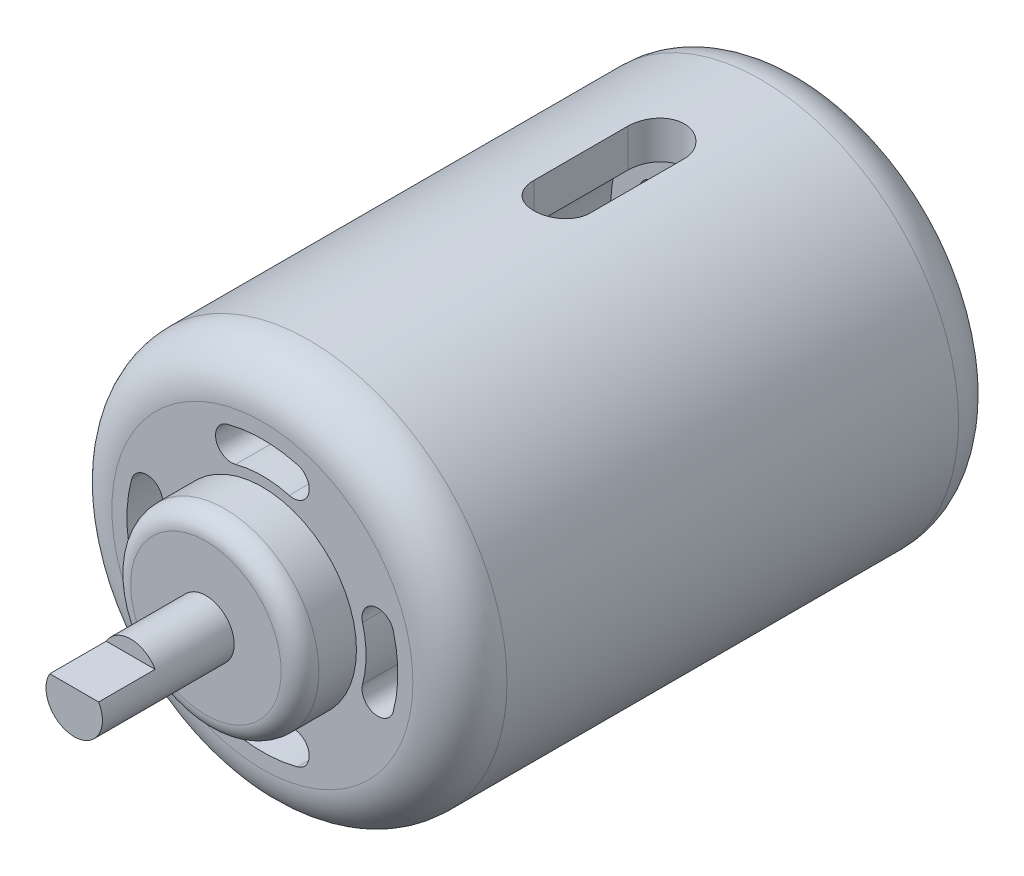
ISO-10303-21;
HEADER;
FILE_DESCRIPTION(('STEP AP214'),'2;1');
FILE_NAME('part.step','',(''),(''),'','','');
FILE_SCHEMA(('AUTOMOTIVE_DESIGN { 1 0 10303 214 1 1 1 1 }'));
ENDSEC;
DATA;
#1=APPLICATION_CONTEXT('core data for automotive mechanical design processes');
#2=APPLICATION_PROTOCOL_DEFINITION('international standard','automotive_design',2000,#1);
#3=PRODUCT_CONTEXT('',#1,'mechanical');
#4=PRODUCT('Part','Part','',(#3));
#5=PRODUCT_RELATED_PRODUCT_CATEGORY('part','',(#4));
#6=PRODUCT_DEFINITION_FORMATION('','',#4);
#7=PRODUCT_DEFINITION_CONTEXT('part definition',#1,'design');
#8=PRODUCT_DEFINITION('design','',#6,#7);
#9=PRODUCT_DEFINITION_SHAPE('','',#8);
#10=(LENGTH_UNIT() NAMED_UNIT(*) SI_UNIT(.MILLI.,.METRE.));
#11=(NAMED_UNIT(*) PLANE_ANGLE_UNIT() SI_UNIT($,.RADIAN.));
#12=(NAMED_UNIT(*) SI_UNIT($,.STERADIAN.) SOLID_ANGLE_UNIT());
#13=UNCERTAINTY_MEASURE_WITH_UNIT(LENGTH_MEASURE(1.E-05),#10,'distance_accuracy_value','');
#14=(GEOMETRIC_REPRESENTATION_CONTEXT(3) GLOBAL_UNCERTAINTY_ASSIGNED_CONTEXT((#13)) GLOBAL_UNIT_ASSIGNED_CONTEXT((#10,
#11,#12)) REPRESENTATION_CONTEXT('',''));
#15=CARTESIAN_POINT('',(0.,0.,0.));
#16=DIRECTION('',(0.,0.,1.));
#17=DIRECTION('',(1.,0.,0.));
#18=AXIS2_PLACEMENT_3D('',#15,#16,#17);
#19=CARTESIAN_POINT('',(0.,0.,30.));
#20=DIRECTION('',(0.,0.,1.));
#21=DIRECTION('',(1.,0.,0.));
#22=AXIS2_PLACEMENT_3D('',#19,#20,#21);
#23=PLANE('',#22);
#24=CARTESIAN_POINT('',(0.,0.,30.));
#25=DIRECTION('',(0.,0.,1.));
#26=DIRECTION('',(1.,0.,0.));
#27=AXIS2_PLACEMENT_3D('',#24,#25,#26);
#28=CIRCLE('',#27,4.);
#29=CARTESIAN_POINT('',(4.,0.,30.));
#30=VERTEX_POINT('',#29);
#31=EDGE_CURVE('E39',#30,#30,#28,.T.);
#32=ORIENTED_EDGE('',*,*,#31,.T.);
#33=EDGE_LOOP('',(#32));
#34=FACE_BOUND('',#33,.T.);
#35=CARTESIAN_POINT('',(0.,0.,30.));
#36=DIRECTION('',(0.,0.,1.));
#37=DIRECTION('',(1.,0.,0.));
#38=AXIS2_PLACEMENT_3D('',#35,#36,#37);
#39=CIRCLE('',#38,1.5);
#40=CARTESIAN_POINT('',(1.5,0.,30.));
#41=VERTEX_POINT('',#40);
#42=EDGE_CURVE('E681',#41,#41,#39,.T.);
#43=ORIENTED_EDGE('',*,*,#42,.F.);
#44=EDGE_LOOP('',(#43));
#45=FACE_BOUND('',#44,.T.);
#46=ADVANCED_FACE('F30',(#34,#45),#23,.T.);
#47=CARTESIAN_POINT('',(0.,0.,27.));
#48=DIRECTION('',(0.,0.,1.));
#49=DIRECTION('',(1.,0.,0.));
#50=AXIS2_PLACEMENT_3D('',#47,#48,#49);
#51=PLANE('',#50);
#52=CARTESIAN_POINT('',(-6.13915516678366,-1.64498166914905,27.));
#53=DIRECTION('',(0.,0.,1.));
#54=DIRECTION('',(1.,0.,0.));
#55=AXIS2_PLACEMENT_3D('',#52,#53,#54);
#56=CIRCLE('',#55,0.844278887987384);
#57=CARTESIAN_POINT('',(-6.95466594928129,-1.86349712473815,27.));
#58=VERTEX_POINT('',#57);
#59=CARTESIAN_POINT('',(-5.32364438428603,-1.42646621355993,27.));
#60=VERTEX_POINT('',#59);
#61=EDGE_CURVE('E46',#58,#60,#56,.T.);
#62=ORIENTED_EDGE('',*,*,#61,.F.);
#63=CARTESIAN_POINT('',(0.,0.,27.));
#64=DIRECTION('',(0.,0.,1.));
#65=DIRECTION('',(1.,0.,0.));
#66=AXIS2_PLACEMENT_3D('',#63,#64,#65);
#67=CIRCLE('',#66,7.2);
#68=CARTESIAN_POINT('',(-6.95466594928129,1.86349712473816,27.));
#69=VERTEX_POINT('',#68);
#70=EDGE_CURVE('E320',#69,#58,#67,.T.);
#71=ORIENTED_EDGE('',*,*,#70,.F.);
#72=CARTESIAN_POINT('',(-6.13915516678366,1.64498166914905,27.));
#73=DIRECTION('',(0.,0.,1.));
#74=DIRECTION('',(-1.,0.,0.));
#75=AXIS2_PLACEMENT_3D('',#72,#73,#74);
#76=CIRCLE('',#75,0.844278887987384);
#77=CARTESIAN_POINT('',(-5.32364438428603,1.42646621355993,27.));
#78=VERTEX_POINT('',#77);
#79=EDGE_CURVE('E303',#78,#69,#76,.T.);
#80=ORIENTED_EDGE('',*,*,#79,.F.);
#81=CARTESIAN_POINT('',(0.,0.,27.));
#82=DIRECTION('',(0.,0.,-1.));
#83=DIRECTION('',(1.,0.,0.));
#84=AXIS2_PLACEMENT_3D('',#81,#82,#83);
#85=CIRCLE('',#84,5.51144222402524);
#86=EDGE_CURVE('E312',#60,#78,#85,.T.);
#87=ORIENTED_EDGE('',*,*,#86,.F.);
#88=EDGE_LOOP('',(#62,#71,#80,#87));
#89=FACE_BOUND('',#88,.T.);
#90=CARTESIAN_POINT('',(1.64498166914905,-6.13915516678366,27.));
#91=DIRECTION('',(0.,0.,1.));
#92=DIRECTION('',(1.,0.,0.));
#93=AXIS2_PLACEMENT_3D('',#90,#91,#92);
#94=CIRCLE('',#93,0.844278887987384);
#95=CARTESIAN_POINT('',(1.86349712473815,-6.95466594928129,27.));
#96=VERTEX_POINT('',#95);
#97=CARTESIAN_POINT('',(1.42646621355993,-5.32364438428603,27.));
#98=VERTEX_POINT('',#97);
#99=EDGE_CURVE('E368',#96,#98,#94,.T.);
#100=ORIENTED_EDGE('',*,*,#99,.F.);
#101=CARTESIAN_POINT('',(0.,0.,27.));
#102=DIRECTION('',(0.,0.,1.));
#103=DIRECTION('',(1.,0.,0.));
#104=AXIS2_PLACEMENT_3D('',#101,#102,#103);
#105=CIRCLE('',#104,7.2);
#106=CARTESIAN_POINT('',(-1.86349712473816,-6.95466594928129,27.));
#107=VERTEX_POINT('',#106);
#108=EDGE_CURVE('E376',#107,#96,#105,.T.);
#109=ORIENTED_EDGE('',*,*,#108,.F.);
#110=CARTESIAN_POINT('',(-1.64498166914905,-6.13915516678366,27.));
#111=DIRECTION('',(0.,0.,1.));
#112=DIRECTION('',(-1.,0.,0.));
#113=AXIS2_PLACEMENT_3D('',#110,#111,#112);
#114=CIRCLE('',#113,0.844278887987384);
#115=CARTESIAN_POINT('',(-1.42646621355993,-5.32364438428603,27.));
#116=VERTEX_POINT('',#115);
#117=EDGE_CURVE('E373',#116,#107,#114,.T.);
#118=ORIENTED_EDGE('',*,*,#117,.F.);
#119=CARTESIAN_POINT('',(0.,0.,27.));
#120=DIRECTION('',(0.,0.,-1.));
#121=DIRECTION('',(1.,0.,0.));
#122=AXIS2_PLACEMENT_3D('',#119,#120,#121);
#123=CIRCLE('',#122,5.51144222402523);
#124=EDGE_CURVE('E370',#98,#116,#123,.T.);
#125=ORIENTED_EDGE('',*,*,#124,.F.);
#126=EDGE_LOOP('',(#100,#109,#118,#125));
#127=FACE_BOUND('',#126,.T.);
#128=CARTESIAN_POINT('',(6.13915516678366,1.64498166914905,27.));
#129=DIRECTION('',(0.,0.,1.));
#130=DIRECTION('',(1.,0.,0.));
#131=AXIS2_PLACEMENT_3D('',#128,#129,#130);
#132=CIRCLE('',#131,0.844278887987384);
#133=CARTESIAN_POINT('',(6.95466594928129,1.86349712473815,27.));
#134=VERTEX_POINT('',#133);
#135=CARTESIAN_POINT('',(5.32364438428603,1.42646621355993,27.));
#136=VERTEX_POINT('',#135);
#137=EDGE_CURVE('E430',#134,#136,#132,.T.);
#138=ORIENTED_EDGE('',*,*,#137,.F.);
#139=CARTESIAN_POINT('',(0.,0.,27.));
#140=DIRECTION('',(0.,0.,1.));
#141=DIRECTION('',(1.,0.,0.));
#142=AXIS2_PLACEMENT_3D('',#139,#140,#141);
#143=CIRCLE('',#142,7.2);
#144=CARTESIAN_POINT('',(6.95466594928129,-1.86349712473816,27.));
#145=VERTEX_POINT('',#144);
#146=EDGE_CURVE('E438',#145,#134,#143,.T.);
#147=ORIENTED_EDGE('',*,*,#146,.F.);
#148=CARTESIAN_POINT('',(6.13915516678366,-1.64498166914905,27.));
#149=DIRECTION('',(0.,0.,1.));
#150=DIRECTION('',(-1.,0.,0.));
#151=AXIS2_PLACEMENT_3D('',#148,#149,#150);
#152=CIRCLE('',#151,0.844278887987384);
#153=CARTESIAN_POINT('',(5.32364438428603,-1.42646621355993,27.));
#154=VERTEX_POINT('',#153);
#155=EDGE_CURVE('E435',#154,#145,#152,.T.);
#156=ORIENTED_EDGE('',*,*,#155,.F.);
#157=CARTESIAN_POINT('',(0.,0.,27.));
#158=DIRECTION('',(0.,0.,-1.));
#159=DIRECTION('',(1.,0.,0.));
#160=AXIS2_PLACEMENT_3D('',#157,#158,#159);
#161=CIRCLE('',#160,5.51144222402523);
#162=EDGE_CURVE('E432',#136,#154,#161,.T.);
#163=ORIENTED_EDGE('',*,*,#162,.F.);
#164=EDGE_LOOP('',(#138,#147,#156,#163));
#165=FACE_BOUND('',#164,.T.);
#166=CARTESIAN_POINT('',(-1.64498166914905,6.13915516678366,27.));
#167=DIRECTION('',(0.,0.,1.));
#168=DIRECTION('',(1.,0.,0.));
#169=AXIS2_PLACEMENT_3D('',#166,#167,#168);
#170=CIRCLE('',#169,0.844278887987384);
#171=CARTESIAN_POINT('',(-1.86349712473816,6.95466594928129,27.));
#172=VERTEX_POINT('',#171);
#173=CARTESIAN_POINT('',(-1.42646621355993,5.32364438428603,27.));
#174=VERTEX_POINT('',#173);
#175=EDGE_CURVE('E492',#172,#174,#170,.T.);
#176=ORIENTED_EDGE('',*,*,#175,.F.);
#177=CARTESIAN_POINT('',(0.,0.,27.));
#178=DIRECTION('',(0.,0.,1.));
#179=DIRECTION('',(1.,0.,0.));
#180=AXIS2_PLACEMENT_3D('',#177,#178,#179);
#181=CIRCLE('',#180,7.2);
#182=CARTESIAN_POINT('',(1.86349712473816,6.95466594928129,27.));
#183=VERTEX_POINT('',#182);
#184=EDGE_CURVE('E500',#183,#172,#181,.T.);
#185=ORIENTED_EDGE('',*,*,#184,.F.);
#186=CARTESIAN_POINT('',(1.64498166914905,6.13915516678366,27.));
#187=DIRECTION('',(0.,0.,1.));
#188=DIRECTION('',(-1.,0.,0.));
#189=AXIS2_PLACEMENT_3D('',#186,#187,#188);
#190=CIRCLE('',#189,0.844278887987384);
#191=CARTESIAN_POINT('',(1.42646621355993,5.32364438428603,27.));
#192=VERTEX_POINT('',#191);
#193=EDGE_CURVE('E497',#192,#183,#190,.T.);
#194=ORIENTED_EDGE('',*,*,#193,.F.);
#195=CARTESIAN_POINT('',(0.,0.,27.));
#196=DIRECTION('',(0.,0.,-1.));
#197=DIRECTION('',(1.,0.,0.));
#198=AXIS2_PLACEMENT_3D('',#195,#196,#197);
#199=CIRCLE('',#198,5.51144222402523);
#200=EDGE_CURVE('E494',#174,#192,#199,.T.);
#201=ORIENTED_EDGE('',*,*,#200,.F.);
#202=EDGE_LOOP('',(#176,#185,#194,#201));
#203=FACE_BOUND('',#202,.T.);
#204=CARTESIAN_POINT('',(0.,0.,27.));
#205=DIRECTION('',(0.,0.,1.));
#206=DIRECTION('',(1.,0.,0.));
#207=AXIS2_PLACEMENT_3D('',#204,#205,#206);
#208=CIRCLE('',#207,8.);
#209=CARTESIAN_POINT('',(8.,0.,27.));
#210=VERTEX_POINT('',#209);
#211=EDGE_CURVE('E773',#210,#210,#208,.T.);
#212=ORIENTED_EDGE('',*,*,#211,.T.);
#213=EDGE_LOOP('',(#212));
#214=FACE_BOUND('',#213,.T.);
#215=CARTESIAN_POINT('',(0.,0.,27.));
#216=DIRECTION('',(0.,0.,1.));
#217=DIRECTION('',(1.,0.,0.));
#218=AXIS2_PLACEMENT_3D('',#215,#216,#217);
#219=CIRCLE('',#218,5.);
#220=CARTESIAN_POINT('',(5.,0.,27.));
#221=VERTEX_POINT('',#220);
#222=EDGE_CURVE('E691',#221,#221,#219,.T.);
#223=ORIENTED_EDGE('',*,*,#222,.F.);
#224=EDGE_LOOP('',(#223));
#225=FACE_BOUND('',#224,.T.);
#226=ADVANCED_FACE('F317',(#89,#127,#165,#203,#214,#225),#51,.T.);
#227=CARTESIAN_POINT('',(0.,0.,27.));
#228=DIRECTION('',(0.,0.,-1.));
#229=DIRECTION('',(-1.,0.,0.));
#230=AXIS2_PLACEMENT_3D('',#227,#228,#229);
#231=CYLINDRICAL_SURFACE('',#230,10.5);
#232=CARTESIAN_POINT('',(0.,0.,0.5));
#233=DIRECTION('',(0.,0.,-1.));
#234=DIRECTION('',(-1.,0.,0.));
#235=AXIS2_PLACEMENT_3D('',#232,#233,#234);
#236=CIRCLE('',#235,10.5);
#237=CARTESIAN_POINT('',(-10.5,0.,0.5));
#238=VERTEX_POINT('',#237);
#239=EDGE_CURVE('E775',#238,#238,#236,.F.);
#240=ORIENTED_EDGE('',*,*,#239,.T.);
#241=EDGE_LOOP('',(#240));
#242=FACE_BOUND('',#241,.T.);
#243=CARTESIAN_POINT('',(0.,0.,24.5));
#244=DIRECTION('',(0.,0.,1.));
#245=DIRECTION('',(1.,0.,0.));
#246=AXIS2_PLACEMENT_3D('',#243,#244,#245);
#247=CIRCLE('',#246,10.5);
#248=CARTESIAN_POINT('',(10.5,0.,24.5));
#249=VERTEX_POINT('',#248);
#250=EDGE_CURVE('E780',#249,#249,#247,.F.);
#251=ORIENTED_EDGE('',*,*,#250,.T.);
#252=EDGE_LOOP('',(#251));
#253=FACE_BOUND('',#252,.T.);
#254=DIRECTION('',(0.,0.,-1.));
#255=VECTOR('',#254,1.);
#256=CARTESIAN_POINT('',(-1.5,10.3923048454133,27.));
#257=LINE('',#256,#255);
#258=CARTESIAN_POINT('',(-1.5,10.3923048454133,11.0773496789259));
#259=VERTEX_POINT('',#258);
#260=CARTESIAN_POINT('',(-1.5,10.3923048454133,6.07734967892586));
#261=VERTEX_POINT('',#260);
#262=EDGE_CURVE('E572',#259,#261,#257,.T.);
#263=ORIENTED_EDGE('',*,*,#262,.T.);
#264=CARTESIAN_POINT('',(-1.5,10.3923048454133,6.07734967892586));
#265=CARTESIAN_POINT('',(-1.49999997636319,10.3923033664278,6.0353779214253));
#266=CARTESIAN_POINT('',(-1.49823726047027,10.3925594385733,5.99342648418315));
#267=CARTESIAN_POINT('',(-1.49120675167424,10.3935711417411,5.90982805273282));
#268=CARTESIAN_POINT('',(-1.48593926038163,10.3943267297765,5.86818103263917));
#269=CARTESIAN_POINT('',(-1.4649378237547,10.3973155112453,5.74424779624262));
#270=CARTESIAN_POINT('',(-1.44400472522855,10.4002708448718,5.66279847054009));
#271=CARTESIAN_POINT('',(-1.3888863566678,10.4077739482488,5.50461768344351));
#272=CARTESIAN_POINT('',(-1.35469731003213,10.4123221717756,5.42788757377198));
#273=CARTESIAN_POINT('',(-1.27405390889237,10.4224964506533,5.28124371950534));
#274=CARTESIAN_POINT('',(-1.22760007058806,10.4281224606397,5.21132968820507));
#275=CARTESIAN_POINT('',(-1.12339264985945,10.4398633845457,5.07981566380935));
#276=CARTESIAN_POINT('',(-1.06556866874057,10.4459811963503,5.01827172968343));
#277=CARTESIAN_POINT('',(-0.940407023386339,10.4579911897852,4.9057188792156));
#278=CARTESIAN_POINT('',(-0.873067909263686,10.4638833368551,4.85471157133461));
#279=CARTESIAN_POINT('',(-0.730430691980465,10.4748079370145,4.76448145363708));
#280=CARTESIAN_POINT('',(-0.655099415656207,10.4798365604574,4.72531058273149));
#281=CARTESIAN_POINT('',(-0.498847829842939,10.4884348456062,4.66020012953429));
#282=CARTESIAN_POINT('',(-0.417928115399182,10.4920046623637,4.63425914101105));
#283=CARTESIAN_POINT('',(-0.253376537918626,10.4972628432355,4.59651299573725));
#284=CARTESIAN_POINT('',(-0.169766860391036,10.4989638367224,4.58461291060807));
#285=CARTESIAN_POINT('',(-0.00171920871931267,10.5003359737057,4.57499170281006));
#286=CARTESIAN_POINT('',(0.0827187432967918,10.500007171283,4.57727020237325));
#287=CARTESIAN_POINT('',(0.249374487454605,10.4973668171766,4.59586673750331));
#288=CARTESIAN_POINT('',(0.331603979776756,10.4950697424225,4.612082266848));
#289=CARTESIAN_POINT('',(0.492162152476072,10.4887671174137,4.65793177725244));
#290=CARTESIAN_POINT('',(0.570490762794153,10.4847615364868,4.68756599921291));
#291=CARTESIAN_POINT('',(0.721337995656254,10.475466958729,4.75951844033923));
#292=CARTESIAN_POINT('',(0.793835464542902,10.470173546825,4.80188041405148));
#293=CARTESIAN_POINT('',(0.930728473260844,10.4588942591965,4.89805231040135));
#294=CARTESIAN_POINT('',(0.995123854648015,10.4529083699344,4.95186245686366));
#295=CARTESIAN_POINT('',(1.11458362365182,10.4408499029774,5.06996679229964));
#296=CARTESIAN_POINT('',(1.16956093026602,10.4347770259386,5.13434905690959));
#297=CARTESIAN_POINT('',(1.26795997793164,10.4232787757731,5.27149586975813));
#298=CARTESIAN_POINT('',(1.31137834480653,10.4178535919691,5.34426285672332));
#299=CARTESIAN_POINT('',(1.38543632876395,10.4082644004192,5.49621024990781));
#300=CARTESIAN_POINT('',(1.41606004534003,10.4041019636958,5.57539849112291));
#301=CARTESIAN_POINT('',(1.46350489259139,10.397535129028,5.73781062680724));
#302=CARTESIAN_POINT('',(1.48034674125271,10.3951280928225,5.8210282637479));
#303=CARTESIAN_POINT('',(1.49337659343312,10.3932589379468,5.93360686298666));
#304=CARTESIAN_POINT('',(1.49586149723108,10.3929014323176,5.9623235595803));
#305=CARTESIAN_POINT('',(1.49917100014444,10.3924246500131,6.01980595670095));
#306=CARTESIAN_POINT('',(1.49999838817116,10.3923049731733,6.04857149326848));
#307=CARTESIAN_POINT('',(1.5,10.3923048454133,6.07734967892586));
#308=B_SPLINE_CURVE_WITH_KNOTS('',3,(#264,#265,#266,#267,#268,#269,#270,#271,#272,#273,#274,
#275,#276,#277,#278,#279,#280,#281,#282,#283,#284,#285,#286,#287,#288,#289,#290,#291,#292,#293,
#294,#295,#296,#297,#298,#299,#300,#301,#302,#303,#304,#305,#306,#307),.UNSPECIFIED.,.F.,.F.,(4,
2,2,2,2,2,2,2,2,2,2,2,2,2,2,2,2,2,2,2,2,4),(0.,0.125837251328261,0.251663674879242,
0.502810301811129,0.754028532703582,1.00523619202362,1.25805118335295,1.51090473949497,
1.76485223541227,2.01877273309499,2.27096649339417,2.52315353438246,2.77350147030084,
3.02385390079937,3.2750770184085,3.52630504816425,3.77974343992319,4.03325573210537,
4.28708214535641,4.54052628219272,4.62696900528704,4.71326615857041),.UNSPECIFIED.);
#309=CARTESIAN_POINT('',(1.5,10.3923048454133,6.07734967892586));
#310=VERTEX_POINT('',#309);
#311=EDGE_CURVE('E665',#261,#310,#308,.T.);
#312=ORIENTED_EDGE('',*,*,#311,.T.);
#313=DIRECTION('',(0.,0.,-1.));
#314=VECTOR('',#313,1.);
#315=CARTESIAN_POINT('',(1.50000000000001,10.3923048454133,27.));
#316=LINE('',#315,#314);
#317=CARTESIAN_POINT('',(1.5,10.3923048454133,11.0773496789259));
#318=VERTEX_POINT('',#317);
#319=EDGE_CURVE('E799',#310,#318,#316,.F.);
#320=ORIENTED_EDGE('',*,*,#319,.T.);
#321=CARTESIAN_POINT('',(1.5,10.3923048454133,11.0773496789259));
#322=CARTESIAN_POINT('',(1.4999999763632,10.3923033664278,11.1193214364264));
#323=CARTESIAN_POINT('',(1.49823726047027,10.3925594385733,11.1612728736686));
#324=CARTESIAN_POINT('',(1.49120675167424,10.3935711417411,11.2448713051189));
#325=CARTESIAN_POINT('',(1.48593926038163,10.3943267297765,11.2865183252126));
#326=CARTESIAN_POINT('',(1.4649378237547,10.3973155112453,11.4104515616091));
#327=CARTESIAN_POINT('',(1.44400472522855,10.4002708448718,11.4919008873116));
#328=CARTESIAN_POINT('',(1.38888635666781,10.4077739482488,11.6500816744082));
#329=CARTESIAN_POINT('',(1.35469731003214,10.4123221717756,11.7268117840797));
#330=CARTESIAN_POINT('',(1.27405390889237,10.4224964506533,11.8734556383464));
#331=CARTESIAN_POINT('',(1.22760007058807,10.4281224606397,11.9433696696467));
#332=CARTESIAN_POINT('',(1.12339264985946,10.4398633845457,12.0748836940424));
#333=CARTESIAN_POINT('',(1.06556866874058,10.4459811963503,12.1364276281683));
#334=CARTESIAN_POINT('',(0.940407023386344,10.4579911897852,12.2489804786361));
#335=CARTESIAN_POINT('',(0.873067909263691,10.4638833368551,12.2999877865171));
#336=CARTESIAN_POINT('',(0.73043069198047,10.4748079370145,12.3902179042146));
#337=CARTESIAN_POINT('',(0.655099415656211,10.4798365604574,12.4293887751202));
#338=CARTESIAN_POINT('',(0.498847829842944,10.4884348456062,12.4944992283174));
#339=CARTESIAN_POINT('',(0.417928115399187,10.4920046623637,12.5204402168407));
#340=CARTESIAN_POINT('',(0.253376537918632,10.4972628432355,12.5581863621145));
#341=CARTESIAN_POINT('',(0.169766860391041,10.4989638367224,12.5700864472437));
#342=CARTESIAN_POINT('',(0.00171920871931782,10.5003359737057,12.5797076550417));
#343=CARTESIAN_POINT('',(-0.0827187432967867,10.500007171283,12.5774291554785));
#344=CARTESIAN_POINT('',(-0.2493744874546,10.4973668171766,12.5588326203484));
#345=CARTESIAN_POINT('',(-0.331603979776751,10.4950697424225,12.5426170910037));
#346=CARTESIAN_POINT('',(-0.492162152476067,10.4887671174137,12.4967675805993));
#347=CARTESIAN_POINT('',(-0.570490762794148,10.4847615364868,12.4671333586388));
#348=CARTESIAN_POINT('',(-0.721337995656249,10.475466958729,12.3951809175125));
#349=CARTESIAN_POINT('',(-0.793835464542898,10.470173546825,12.3528189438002));
#350=CARTESIAN_POINT('',(-0.93072847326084,10.4588942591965,12.2566470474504));
#351=CARTESIAN_POINT('',(-0.995123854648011,10.4529083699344,12.2028369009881));
#352=CARTESIAN_POINT('',(-1.11458362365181,10.4408499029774,12.0847325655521));
#353=CARTESIAN_POINT('',(-1.16956093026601,10.4347770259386,12.0203503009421));
#354=CARTESIAN_POINT('',(-1.26795997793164,10.4232787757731,11.8832034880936));
#355=CARTESIAN_POINT('',(-1.31137834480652,10.4178535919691,11.8104365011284));
#356=CARTESIAN_POINT('',(-1.38543632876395,10.4082644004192,11.6584891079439));
#357=CARTESIAN_POINT('',(-1.41606004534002,10.4041019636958,11.5793008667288));
#358=CARTESIAN_POINT('',(-1.46350489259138,10.397535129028,11.4168887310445));
#359=CARTESIAN_POINT('',(-1.48034674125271,10.3951280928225,11.3336710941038));
#360=CARTESIAN_POINT('',(-1.49337659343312,10.3932589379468,11.2210924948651));
#361=CARTESIAN_POINT('',(-1.49586149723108,10.3929014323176,11.1923757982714));
#362=CARTESIAN_POINT('',(-1.49917100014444,10.3924246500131,11.1348934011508));
#363=CARTESIAN_POINT('',(-1.49999838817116,10.3923049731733,11.1061278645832));
#364=CARTESIAN_POINT('',(-1.5,10.3923048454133,11.0773496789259));
#365=B_SPLINE_CURVE_WITH_KNOTS('',3,(#321,#322,#323,#324,#325,#326,#327,#328,#329,#330,#331,
#332,#333,#334,#335,#336,#337,#338,#339,#340,#341,#342,#343,#344,#345,#346,#347,#348,#349,#350,
#351,#352,#353,#354,#355,#356,#357,#358,#359,#360,#361,#362,#363,#364),.UNSPECIFIED.,.F.,.F.,(4,
2,2,2,2,2,2,2,2,2,2,2,2,2,2,2,2,2,2,2,2,4),(0.,0.12583725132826,0.25166367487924,
0.502810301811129,0.754028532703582,1.00523619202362,1.25805118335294,1.51090473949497,
1.76485223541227,2.01877273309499,2.27096649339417,2.52315353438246,2.77350147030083,
3.02385390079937,3.2750770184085,3.52630504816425,3.77974343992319,4.03325573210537,
4.28708214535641,4.54052628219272,4.62696900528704,4.71326615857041),.UNSPECIFIED.);
#366=EDGE_CURVE('E582',#318,#259,#365,.T.);
#367=ORIENTED_EDGE('',*,*,#366,.T.);
#368=EDGE_LOOP('',(#263,#312,#320,#367));
#369=FACE_BOUND('',#368,.T.);
#370=DIRECTION('',(0.,0.,-1.));
#371=VECTOR('',#370,1.);
#372=CARTESIAN_POINT('',(1.50000000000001,-10.3923048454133,27.));
#373=LINE('',#372,#371);
#374=CARTESIAN_POINT('',(1.5,-10.3923048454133,11.0773496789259));
#375=VERTEX_POINT('',#374);
#376=CARTESIAN_POINT('',(1.5,-10.3923048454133,6.07734967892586));
#377=VERTEX_POINT('',#376);
#378=EDGE_CURVE('E666',#375,#377,#373,.T.);
#379=ORIENTED_EDGE('',*,*,#378,.T.);
#380=CARTESIAN_POINT('',(1.5,-10.3923048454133,6.07734967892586));
#381=CARTESIAN_POINT('',(1.4999999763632,-10.3923033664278,6.03537792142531));
#382=CARTESIAN_POINT('',(1.49823726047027,-10.3925594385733,5.99342648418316));
#383=CARTESIAN_POINT('',(1.49120675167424,-10.3935711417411,5.90982805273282));
#384=CARTESIAN_POINT('',(1.48593926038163,-10.3943267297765,5.86818103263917));
#385=CARTESIAN_POINT('',(1.4649378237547,-10.3973155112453,5.74424779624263));
#386=CARTESIAN_POINT('',(1.44400472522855,-10.4002708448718,5.66279847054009));
#387=CARTESIAN_POINT('',(1.38888635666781,-10.4077739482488,5.50461768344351));
#388=CARTESIAN_POINT('',(1.35469731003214,-10.4123221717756,5.42788757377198));
#389=CARTESIAN_POINT('',(1.27405390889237,-10.4224964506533,5.28124371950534));
#390=CARTESIAN_POINT('',(1.22760007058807,-10.4281224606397,5.21132968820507));
#391=CARTESIAN_POINT('',(1.12339264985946,-10.4398633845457,5.07981566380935));
#392=CARTESIAN_POINT('',(1.06556866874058,-10.4459811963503,5.01827172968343));
#393=CARTESIAN_POINT('',(0.940407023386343,-10.4579911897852,4.9057188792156));
#394=CARTESIAN_POINT('',(0.87306790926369,-10.4638833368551,4.85471157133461));
#395=CARTESIAN_POINT('',(0.730430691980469,-10.4748079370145,4.76448145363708));
#396=CARTESIAN_POINT('',(0.655099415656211,-10.4798365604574,4.72531058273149));
#397=CARTESIAN_POINT('',(0.498847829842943,-10.4884348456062,4.66020012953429));
#398=CARTESIAN_POINT('',(0.417928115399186,-10.4920046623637,4.63425914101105));
#399=CARTESIAN_POINT('',(0.25337653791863,-10.4972628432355,4.59651299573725));
#400=CARTESIAN_POINT('',(0.16976686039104,-10.4989638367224,4.58461291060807));
#401=CARTESIAN_POINT('',(0.00171920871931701,-10.5003359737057,4.57499170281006));
#402=CARTESIAN_POINT('',(-0.0827187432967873,-10.500007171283,4.57727020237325));
#403=CARTESIAN_POINT('',(-0.249374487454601,-10.4973668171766,4.59586673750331));
#404=CARTESIAN_POINT('',(-0.331603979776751,-10.4950697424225,4.612082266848));
#405=CARTESIAN_POINT('',(-0.492162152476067,-10.4887671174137,4.65793177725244));
#406=CARTESIAN_POINT('',(-0.570490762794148,-10.4847615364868,4.68756599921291));
#407=CARTESIAN_POINT('',(-0.721337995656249,-10.475466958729,4.75951844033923));
#408=CARTESIAN_POINT('',(-0.793835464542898,-10.470173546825,4.80188041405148));
#409=CARTESIAN_POINT('',(-0.93072847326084,-10.4588942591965,4.89805231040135));
#410=CARTESIAN_POINT('',(-0.99512385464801,-10.4529083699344,4.95186245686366));
#411=CARTESIAN_POINT('',(-1.11458362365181,-10.4408499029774,5.06996679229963));
#412=CARTESIAN_POINT('',(-1.16956093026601,-10.4347770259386,5.13434905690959));
#413=CARTESIAN_POINT('',(-1.26795997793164,-10.4232787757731,5.27149586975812));
#414=CARTESIAN_POINT('',(-1.31137834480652,-10.4178535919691,5.34426285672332));
#415=CARTESIAN_POINT('',(-1.38543632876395,-10.4082644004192,5.4962102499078));
#416=CARTESIAN_POINT('',(-1.41606004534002,-10.4041019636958,5.57539849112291));
#417=CARTESIAN_POINT('',(-1.46350489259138,-10.397535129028,5.73781062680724));
#418=CARTESIAN_POINT('',(-1.48034674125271,-10.3951280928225,5.82102826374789));
#419=CARTESIAN_POINT('',(-1.49337659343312,-10.3932589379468,5.93360686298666));
#420=CARTESIAN_POINT('',(-1.49586149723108,-10.3929014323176,5.9623235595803));
#421=CARTESIAN_POINT('',(-1.49917100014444,-10.3924246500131,6.01980595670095));
#422=CARTESIAN_POINT('',(-1.49999838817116,-10.3923049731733,6.04857149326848));
#423=CARTESIAN_POINT('',(-1.5,-10.3923048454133,6.07734967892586));
#424=B_SPLINE_CURVE_WITH_KNOTS('',3,(#380,#381,#382,#383,#384,#385,#386,#387,#388,#389,#390,
#391,#392,#393,#394,#395,#396,#397,#398,#399,#400,#401,#402,#403,#404,#405,#406,#407,#408,#409,
#410,#411,#412,#413,#414,#415,#416,#417,#418,#419,#420,#421,#422,#423),.UNSPECIFIED.,.F.,.F.,(4,
2,2,2,2,2,2,2,2,2,2,2,2,2,2,2,2,2,2,2,2,4),(0.,0.125837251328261,0.251663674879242,
0.502810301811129,0.754028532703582,1.00523619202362,1.25805118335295,1.51090473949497,
1.76485223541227,2.01877273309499,2.27096649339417,2.52315353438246,2.77350147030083,
3.02385390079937,3.2750770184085,3.52630504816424,3.77974343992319,4.03325573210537,
4.28708214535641,4.54052628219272,4.62696900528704,4.71326615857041),.UNSPECIFIED.);
#425=CARTESIAN_POINT('',(-1.5,-10.3923048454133,6.07734967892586));
#426=VERTEX_POINT('',#425);
#427=EDGE_CURVE('E659',#377,#426,#424,.T.);
#428=ORIENTED_EDGE('',*,*,#427,.T.);
#429=DIRECTION('',(0.,0.,-1.));
#430=VECTOR('',#429,1.);
#431=CARTESIAN_POINT('',(-1.5,-10.3923048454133,27.));
#432=LINE('',#431,#430);
#433=CARTESIAN_POINT('',(-1.5,-10.3923048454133,11.0773496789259));
#434=VERTEX_POINT('',#433);
#435=EDGE_CURVE('E569',#426,#434,#432,.F.);
#436=ORIENTED_EDGE('',*,*,#435,.T.);
#437=CARTESIAN_POINT('',(-1.5,-10.3923048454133,11.0773496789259));
#438=CARTESIAN_POINT('',(-1.49999997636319,-10.3923033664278,11.1193214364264));
#439=CARTESIAN_POINT('',(-1.49823726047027,-10.3925594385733,11.1612728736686));
#440=CARTESIAN_POINT('',(-1.49120675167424,-10.3935711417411,11.2448713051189));
#441=CARTESIAN_POINT('',(-1.48593926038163,-10.3943267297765,11.2865183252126));
#442=CARTESIAN_POINT('',(-1.4649378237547,-10.3973155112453,11.4104515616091));
#443=CARTESIAN_POINT('',(-1.44400472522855,-10.4002708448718,11.4919008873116));
#444=CARTESIAN_POINT('',(-1.3888863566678,-10.4077739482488,11.6500816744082));
#445=CARTESIAN_POINT('',(-1.35469731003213,-10.4123221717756,11.7268117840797));
#446=CARTESIAN_POINT('',(-1.27405390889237,-10.4224964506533,11.8734556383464));
#447=CARTESIAN_POINT('',(-1.22760007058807,-10.4281224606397,11.9433696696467));
#448=CARTESIAN_POINT('',(-1.12339264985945,-10.4398633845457,12.0748836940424));
#449=CARTESIAN_POINT('',(-1.06556866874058,-10.4459811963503,12.1364276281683));
#450=CARTESIAN_POINT('',(-0.940407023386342,-10.4579911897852,12.2489804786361));
#451=CARTESIAN_POINT('',(-0.87306790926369,-10.4638833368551,12.2999877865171));
#452=CARTESIAN_POINT('',(-0.730430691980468,-10.4748079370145,12.3902179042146));
#453=CARTESIAN_POINT('',(-0.655099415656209,-10.4798365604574,12.4293887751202));
#454=CARTESIAN_POINT('',(-0.498847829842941,-10.4884348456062,12.4944992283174));
#455=CARTESIAN_POINT('',(-0.417928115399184,-10.4920046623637,12.5204402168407));
#456=CARTESIAN_POINT('',(-0.253376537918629,-10.4972628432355,12.5581863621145));
#457=CARTESIAN_POINT('',(-0.169766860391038,-10.4989638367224,12.5700864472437));
#458=CARTESIAN_POINT('',(-0.00171920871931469,-10.5003359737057,12.5797076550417));
#459=CARTESIAN_POINT('',(0.0827187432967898,-10.500007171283,12.5774291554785));
#460=CARTESIAN_POINT('',(0.249374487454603,-10.4973668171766,12.5588326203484));
#461=CARTESIAN_POINT('',(0.331603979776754,-10.4950697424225,12.5426170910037));
#462=CARTESIAN_POINT('',(0.49216215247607,-10.4887671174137,12.4967675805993));
#463=CARTESIAN_POINT('',(0.570490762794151,-10.4847615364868,12.4671333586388));
#464=CARTESIAN_POINT('',(0.721337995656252,-10.475466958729,12.3951809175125));
#465=CARTESIAN_POINT('',(0.793835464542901,-10.470173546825,12.3528189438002));
#466=CARTESIAN_POINT('',(0.930728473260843,-10.4588942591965,12.2566470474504));
#467=CARTESIAN_POINT('',(0.995123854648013,-10.4529083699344,12.2028369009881));
#468=CARTESIAN_POINT('',(1.11458362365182,-10.4408499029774,12.0847325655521));
#469=CARTESIAN_POINT('',(1.16956093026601,-10.4347770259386,12.0203503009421));
#470=CARTESIAN_POINT('',(1.26795997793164,-10.4232787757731,11.8832034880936));
#471=CARTESIAN_POINT('',(1.31137834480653,-10.4178535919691,11.8104365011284));
#472=CARTESIAN_POINT('',(1.38543632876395,-10.4082644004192,11.6584891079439));
#473=CARTESIAN_POINT('',(1.41606004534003,-10.4041019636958,11.5793008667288));
#474=CARTESIAN_POINT('',(1.46350489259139,-10.397535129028,11.4168887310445));
#475=CARTESIAN_POINT('',(1.48034674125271,-10.3951280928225,11.3336710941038));
#476=CARTESIAN_POINT('',(1.49337659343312,-10.3932589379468,11.2210924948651));
#477=CARTESIAN_POINT('',(1.49586149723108,-10.3929014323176,11.1923757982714));
#478=CARTESIAN_POINT('',(1.49917100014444,-10.3924246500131,11.1348934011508));
#479=CARTESIAN_POINT('',(1.49999838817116,-10.3923049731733,11.1061278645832));
#480=CARTESIAN_POINT('',(1.5,-10.3923048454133,11.0773496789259));
#481=B_SPLINE_CURVE_WITH_KNOTS('',3,(#437,#438,#439,#440,#441,#442,#443,#444,#445,#446,#447,
#448,#449,#450,#451,#452,#453,#454,#455,#456,#457,#458,#459,#460,#461,#462,#463,#464,#465,#466,
#467,#468,#469,#470,#471,#472,#473,#474,#475,#476,#477,#478,#479,#480),.UNSPECIFIED.,.F.,.F.,(4,
2,2,2,2,2,2,2,2,2,2,2,2,2,2,2,2,2,2,2,2,4),(0.,0.12583725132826,0.251663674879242,
0.502810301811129,0.754028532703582,1.00523619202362,1.25805118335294,1.51090473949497,
1.76485223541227,2.01877273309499,2.27096649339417,2.52315353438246,2.77350147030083,
3.02385390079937,3.2750770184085,3.52630504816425,3.77974343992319,4.03325573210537,
4.28708214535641,4.54052628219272,4.62696900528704,4.71326615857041),.UNSPECIFIED.);
#482=EDGE_CURVE('E575',#434,#375,#481,.T.);
#483=ORIENTED_EDGE('',*,*,#482,.T.);
#484=EDGE_LOOP('',(#379,#428,#436,#483));
#485=FACE_BOUND('',#484,.T.);
#486=ADVANCED_FACE('F32',(#242,#253,#369,#485),#231,.T.);
#487=CARTESIAN_POINT('',(0.,0.,30.));
#488=DIRECTION('',(0.,0.,-1.));
#489=DIRECTION('',(-1.,0.,0.));
#490=AXIS2_PLACEMENT_3D('',#487,#488,#489);
#491=CYLINDRICAL_SURFACE('',#490,5.);
#492=CARTESIAN_POINT('',(0.,0.,29.));
#493=DIRECTION('',(0.,0.,1.));
#494=DIRECTION('',(1.,0.,0.));
#495=AXIS2_PLACEMENT_3D('',#492,#493,#494);
#496=CIRCLE('',#495,5.);
#497=CARTESIAN_POINT('',(5.,0.,29.));
#498=VERTEX_POINT('',#497);
#499=EDGE_CURVE('E11',#498,#498,#496,.F.);
#500=ORIENTED_EDGE('',*,*,#499,.T.);
#501=EDGE_LOOP('',(#500));
#502=FACE_BOUND('',#501,.T.);
#503=ORIENTED_EDGE('',*,*,#222,.T.);
#504=EDGE_LOOP('',(#503));
#505=FACE_BOUND('',#504,.T.);
#506=ADVANCED_FACE('F752',(#502,#505),#491,.T.);
#507=CARTESIAN_POINT('',(0.,0.,25.));
#508=DIRECTION('',(0.,0.,1.));
#509=DIRECTION('',(1.,0.,0.));
#510=AXIS2_PLACEMENT_3D('',#507,#508,#509);
#511=PLANE('',#510);
#512=CARTESIAN_POINT('',(0.,0.,25.));
#513=DIRECTION('',(0.,0.,1.));
#514=DIRECTION('',(1.,0.,0.));
#515=AXIS2_PLACEMENT_3D('',#512,#513,#514);
#516=CIRCLE('',#515,7.2);
#517=CARTESIAN_POINT('',(-6.95466594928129,1.86349712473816,25.));
#518=VERTEX_POINT('',#517);
#519=CARTESIAN_POINT('',(-6.95466594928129,-1.86349712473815,25.));
#520=VERTEX_POINT('',#519);
#521=EDGE_CURVE('E359',#518,#520,#516,.T.);
#522=ORIENTED_EDGE('',*,*,#521,.T.);
#523=CARTESIAN_POINT('',(-6.13915516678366,-1.64498166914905,25.));
#524=DIRECTION('',(0.,0.,1.));
#525=DIRECTION('',(1.,0.,0.));
#526=AXIS2_PLACEMENT_3D('',#523,#524,#525);
#527=CIRCLE('',#526,0.844278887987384);
#528=CARTESIAN_POINT('',(-5.32364438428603,-1.42646621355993,25.));
#529=VERTEX_POINT('',#528);
#530=EDGE_CURVE('E365',#520,#529,#527,.T.);
#531=ORIENTED_EDGE('',*,*,#530,.T.);
#532=CARTESIAN_POINT('',(0.,0.,25.));
#533=DIRECTION('',(0.,0.,1.));
#534=DIRECTION('',(1.,0.,0.));
#535=AXIS2_PLACEMENT_3D('',#532,#533,#534);
#536=CIRCLE('',#535,5.51144222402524);
#537=CARTESIAN_POINT('',(-5.32364438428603,1.42646621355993,25.));
#538=VERTEX_POINT('',#537);
#539=EDGE_CURVE('E350',#529,#538,#536,.F.);
#540=ORIENTED_EDGE('',*,*,#539,.T.);
#541=CARTESIAN_POINT('',(-6.13915516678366,1.64498166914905,25.));
#542=DIRECTION('',(0.,0.,1.));
#543=DIRECTION('',(1.,0.,0.));
#544=AXIS2_PLACEMENT_3D('',#541,#542,#543);
#545=CIRCLE('',#544,0.844278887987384);
#546=EDGE_CURVE('E306',#538,#518,#545,.T.);
#547=ORIENTED_EDGE('',*,*,#546,.T.);
#548=EDGE_LOOP('',(#522,#531,#540,#547));
#549=FACE_BOUND('',#548,.T.);
#550=CARTESIAN_POINT('',(0.,0.,25.));
#551=DIRECTION('',(0.,0.,1.));
#552=DIRECTION('',(1.,0.,0.));
#553=AXIS2_PLACEMENT_3D('',#550,#551,#552);
#554=CIRCLE('',#553,7.2);
#555=CARTESIAN_POINT('',(-1.86349712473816,-6.95466594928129,25.));
#556=VERTEX_POINT('',#555);
#557=CARTESIAN_POINT('',(1.86349712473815,-6.95466594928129,25.));
#558=VERTEX_POINT('',#557);
#559=EDGE_CURVE('E421',#556,#558,#554,.T.);
#560=ORIENTED_EDGE('',*,*,#559,.T.);
#561=CARTESIAN_POINT('',(1.64498166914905,-6.13915516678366,25.));
#562=DIRECTION('',(0.,0.,1.));
#563=DIRECTION('',(1.,0.,0.));
#564=AXIS2_PLACEMENT_3D('',#561,#562,#563);
#565=CIRCLE('',#564,0.844278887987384);
#566=CARTESIAN_POINT('',(1.42646621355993,-5.32364438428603,25.));
#567=VERTEX_POINT('',#566);
#568=EDGE_CURVE('E427',#558,#567,#565,.T.);
#569=ORIENTED_EDGE('',*,*,#568,.T.);
#570=CARTESIAN_POINT('',(0.,0.,25.));
#571=DIRECTION('',(0.,0.,1.));
#572=DIRECTION('',(1.,0.,0.));
#573=AXIS2_PLACEMENT_3D('',#570,#571,#572);
#574=CIRCLE('',#573,5.51144222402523);
#575=CARTESIAN_POINT('',(-1.42646621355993,-5.32364438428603,25.));
#576=VERTEX_POINT('',#575);
#577=EDGE_CURVE('E409',#567,#576,#574,.F.);
#578=ORIENTED_EDGE('',*,*,#577,.T.);
#579=CARTESIAN_POINT('',(-1.64498166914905,-6.13915516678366,25.));
#580=DIRECTION('',(0.,0.,1.));
#581=DIRECTION('',(1.,0.,0.));
#582=AXIS2_PLACEMENT_3D('',#579,#580,#581);
#583=CIRCLE('',#582,0.844278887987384);
#584=EDGE_CURVE('E415',#576,#556,#583,.T.);
#585=ORIENTED_EDGE('',*,*,#584,.T.);
#586=EDGE_LOOP('',(#560,#569,#578,#585));
#587=FACE_BOUND('',#586,.T.);
#588=CARTESIAN_POINT('',(0.,0.,25.));
#589=DIRECTION('',(0.,0.,1.));
#590=DIRECTION('',(1.,0.,0.));
#591=AXIS2_PLACEMENT_3D('',#588,#589,#590);
#592=CIRCLE('',#591,7.2);
#593=CARTESIAN_POINT('',(6.95466594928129,-1.86349712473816,25.));
#594=VERTEX_POINT('',#593);
#595=CARTESIAN_POINT('',(6.95466594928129,1.86349712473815,25.));
#596=VERTEX_POINT('',#595);
#597=EDGE_CURVE('E483',#594,#596,#592,.T.);
#598=ORIENTED_EDGE('',*,*,#597,.T.);
#599=CARTESIAN_POINT('',(6.13915516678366,1.64498166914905,25.));
#600=DIRECTION('',(0.,0.,1.));
#601=DIRECTION('',(1.,0.,0.));
#602=AXIS2_PLACEMENT_3D('',#599,#600,#601);
#603=CIRCLE('',#602,0.844278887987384);
#604=CARTESIAN_POINT('',(5.32364438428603,1.42646621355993,25.));
#605=VERTEX_POINT('',#604);
#606=EDGE_CURVE('E489',#596,#605,#603,.T.);
#607=ORIENTED_EDGE('',*,*,#606,.T.);
#608=CARTESIAN_POINT('',(0.,0.,25.));
#609=DIRECTION('',(0.,0.,1.));
#610=DIRECTION('',(1.,0.,0.));
#611=AXIS2_PLACEMENT_3D('',#608,#609,#610);
#612=CIRCLE('',#611,5.51144222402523);
#613=CARTESIAN_POINT('',(5.32364438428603,-1.42646621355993,25.));
#614=VERTEX_POINT('',#613);
#615=EDGE_CURVE('E471',#605,#614,#612,.F.);
#616=ORIENTED_EDGE('',*,*,#615,.T.);
#617=CARTESIAN_POINT('',(6.13915516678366,-1.64498166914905,25.));
#618=DIRECTION('',(0.,0.,1.));
#619=DIRECTION('',(1.,0.,0.));
#620=AXIS2_PLACEMENT_3D('',#617,#618,#619);
#621=CIRCLE('',#620,0.844278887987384);
#622=EDGE_CURVE('E477',#614,#594,#621,.T.);
#623=ORIENTED_EDGE('',*,*,#622,.T.);
#624=EDGE_LOOP('',(#598,#607,#616,#623));
#625=FACE_BOUND('',#624,.T.);
#626=CARTESIAN_POINT('',(0.,0.,25.));
#627=DIRECTION('',(0.,0.,1.));
#628=DIRECTION('',(1.,0.,0.));
#629=AXIS2_PLACEMENT_3D('',#626,#627,#628);
#630=CIRCLE('',#629,7.2);
#631=CARTESIAN_POINT('',(1.86349712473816,6.95466594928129,25.));
#632=VERTEX_POINT('',#631);
#633=CARTESIAN_POINT('',(-1.86349712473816,6.95466594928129,25.));
#634=VERTEX_POINT('',#633);
#635=EDGE_CURVE('E545',#632,#634,#630,.T.);
#636=ORIENTED_EDGE('',*,*,#635,.T.);
#637=CARTESIAN_POINT('',(-1.64498166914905,6.13915516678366,25.));
#638=DIRECTION('',(0.,0.,1.));
#639=DIRECTION('',(1.,0.,0.));
#640=AXIS2_PLACEMENT_3D('',#637,#638,#639);
#641=CIRCLE('',#640,0.844278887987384);
#642=CARTESIAN_POINT('',(-1.42646621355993,5.32364438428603,25.));
#643=VERTEX_POINT('',#642);
#644=EDGE_CURVE('E551',#634,#643,#641,.T.);
#645=ORIENTED_EDGE('',*,*,#644,.T.);
#646=CARTESIAN_POINT('',(0.,0.,25.));
#647=DIRECTION('',(0.,0.,1.));
#648=DIRECTION('',(1.,0.,0.));
#649=AXIS2_PLACEMENT_3D('',#646,#647,#648);
#650=CIRCLE('',#649,5.51144222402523);
#651=CARTESIAN_POINT('',(1.42646621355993,5.32364438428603,25.));
#652=VERTEX_POINT('',#651);
#653=EDGE_CURVE('E533',#643,#652,#650,.F.);
#654=ORIENTED_EDGE('',*,*,#653,.T.);
#655=CARTESIAN_POINT('',(1.64498166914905,6.13915516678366,25.));
#656=DIRECTION('',(0.,0.,1.));
#657=DIRECTION('',(1.,0.,0.));
#658=AXIS2_PLACEMENT_3D('',#655,#656,#657);
#659=CIRCLE('',#658,0.844278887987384);
#660=EDGE_CURVE('E539',#652,#632,#659,.T.);
#661=ORIENTED_EDGE('',*,*,#660,.T.);
#662=EDGE_LOOP('',(#636,#645,#654,#661));
#663=FACE_BOUND('',#662,.T.);
#664=CARTESIAN_POINT('',(0.,0.,25.));
#665=DIRECTION('',(0.,0.,1.));
#666=DIRECTION('',(1.,0.,0.));
#667=AXIS2_PLACEMENT_3D('',#664,#665,#666);
#668=CIRCLE('',#667,8.5);
#669=CARTESIAN_POINT('',(8.5,0.,25.));
#670=VERTEX_POINT('',#669);
#671=EDGE_CURVE('E688',#670,#670,#668,.T.);
#672=ORIENTED_EDGE('',*,*,#671,.F.);
#673=EDGE_LOOP('',(#672));
#674=FACE_BOUND('',#673,.T.);
#675=CARTESIAN_POINT('',(0.,0.,25.));
#676=DIRECTION('',(0.,0.,1.));
#677=DIRECTION('',(1.,0.,0.));
#678=AXIS2_PLACEMENT_3D('',#675,#676,#677);
#679=CIRCLE('',#678,3.);
#680=CARTESIAN_POINT('',(3.,0.,25.));
#681=VERTEX_POINT('',#680);
#682=EDGE_CURVE('E687',#681,#681,#679,.T.);
#683=ORIENTED_EDGE('',*,*,#682,.T.);
#684=EDGE_LOOP('',(#683));
#685=FACE_BOUND('',#684,.T.);
#686=ADVANCED_FACE('F628',(#549,#587,#625,#663,#674,#685),#511,.F.);
#687=CARTESIAN_POINT('',(0.,0.,27.));
#688=DIRECTION('',(0.,0.,-1.));
#689=DIRECTION('',(-1.,0.,0.));
#690=AXIS2_PLACEMENT_3D('',#687,#688,#689);
#691=CYLINDRICAL_SURFACE('',#690,8.5);
#692=CARTESIAN_POINT('',(-1.5,8.36660026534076,6.07734967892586));
#693=CARTESIAN_POINT('',(-1.50000011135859,8.366598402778,6.03549906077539));
#694=CARTESIAN_POINT('',(-1.49824741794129,8.36691467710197,5.99366882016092));
#695=CARTESIAN_POINT('',(-1.49125777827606,8.3681640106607,5.91031420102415));
#696=CARTESIAN_POINT('',(-1.48602120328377,8.36909700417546,5.86878979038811));
#697=CARTESIAN_POINT('',(-1.46514818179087,8.37278645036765,5.74524331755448));
#698=CARTESIAN_POINT('',(-1.44434821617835,8.37643353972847,5.66405916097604));
#699=CARTESIAN_POINT('',(-1.38960356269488,8.3856879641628,5.50640581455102));
#700=CARTESIAN_POINT('',(-1.35565638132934,8.39129567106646,5.42993752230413));
#701=CARTESIAN_POINT('',(-1.27560337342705,8.40383672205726,5.28376492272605));
#702=CARTESIAN_POINT('',(-1.22949708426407,8.41077011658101,5.21406087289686));
#703=CARTESIAN_POINT('',(-1.12590102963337,8.42526563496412,5.08265559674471));
#704=CARTESIAN_POINT('',(-1.0683044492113,8.43283323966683,5.02103921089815));
#705=CARTESIAN_POINT('',(-0.943586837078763,8.44769677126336,4.90828524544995));
#706=CARTESIAN_POINT('',(-0.876464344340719,8.45499265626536,4.85714927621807));
#707=CARTESIAN_POINT('',(-0.734046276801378,8.46854880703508,4.76649183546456));
#708=CARTESIAN_POINT('',(-0.658698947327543,8.47480180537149,4.72705049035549));
#709=CARTESIAN_POINT('',(-0.50232349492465,8.48550558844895,4.66141914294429));
#710=CARTESIAN_POINT('',(-0.421296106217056,8.48995660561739,4.63522743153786));
#711=CARTESIAN_POINT('',(-0.256742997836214,8.49651635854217,4.59709896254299));
#712=CARTESIAN_POINT('',(-0.173251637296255,8.49864876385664,4.58501805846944));
#713=CARTESIAN_POINT('',(-0.00539963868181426,8.500412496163,4.5750054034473));
#714=CARTESIAN_POINT('',(0.0789609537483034,8.50004395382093,4.577072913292));
#715=CARTESIAN_POINT('',(0.245165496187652,8.49686584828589,4.59518736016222));
#716=CARTESIAN_POINT('',(0.327026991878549,8.49408344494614,4.61107876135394));
#717=CARTESIAN_POINT('',(0.486902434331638,8.48642063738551,4.65614438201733));
#718=CARTESIAN_POINT('',(0.564916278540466,8.48154017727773,4.68531895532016));
#719=CARTESIAN_POINT('',(0.715341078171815,8.47018366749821,4.75627493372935));
#720=CARTESIAN_POINT('',(0.787721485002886,8.46369962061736,4.79811976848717));
#721=CARTESIAN_POINT('',(0.924488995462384,8.44985515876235,4.89318045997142));
#722=CARTESIAN_POINT('',(0.988875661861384,8.44249469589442,4.94639693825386));
#723=CARTESIAN_POINT('',(1.10874335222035,8.42759704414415,5.06354235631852));
#724=CARTESIAN_POINT('',(1.16409268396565,8.42005881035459,5.12760598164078));
#725=CARTESIAN_POINT('',(1.26329447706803,8.40574849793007,5.26420042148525));
#726=CARTESIAN_POINT('',(1.3071436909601,8.39897663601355,5.33673361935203));
#727=CARTESIAN_POINT('',(1.38213228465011,8.38696375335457,5.48838130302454));
#728=CARTESIAN_POINT('',(1.41324691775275,8.38172571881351,5.56750824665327));
#729=CARTESIAN_POINT('',(1.46166112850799,8.37341986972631,5.72992581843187));
#730=CARTESIAN_POINT('',(1.47898133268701,8.37034881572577,5.81321003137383));
#731=CARTESIAN_POINT('',(1.49276888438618,8.36789388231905,5.92717225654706));
#732=CARTESIAN_POINT('',(1.49548163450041,8.36740923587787,5.95716806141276));
#733=CARTESIAN_POINT('',(1.49909485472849,8.36676273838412,6.01722139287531));
#734=CARTESIAN_POINT('',(1.4999983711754,8.36660034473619,6.0472787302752));
#735=CARTESIAN_POINT('',(1.5,8.36660026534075,6.07734967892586));
#736=B_SPLINE_CURVE_WITH_KNOTS('',3,(#692,#693,#694,#695,#696,#697,#698,#699,#700,#701,#702,
#703,#704,#705,#706,#707,#708,#709,#710,#711,#712,#713,#714,#715,#716,#717,#718,#719,#720,#721,
#722,#723,#724,#725,#726,#727,#728,#729,#730,#731,#732,#733,#734,#735),.UNSPECIFIED.,.F.,.F.,(4,
2,2,2,2,2,2,2,2,2,2,2,2,2,2,2,2,2,2,2,2,4),(0.,0.125473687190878,0.250934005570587,
0.501295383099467,0.751704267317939,1.00212268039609,1.25498766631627,1.50789147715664,
1.76249002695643,2.01705572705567,2.26899756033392,2.52092623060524,2.77005652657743,
3.0191934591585,3.26959883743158,3.52001790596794,3.77381131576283,4.02767631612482,
4.28203232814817,4.536007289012,4.62633117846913,4.71650285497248),.UNSPECIFIED.);
#737=CARTESIAN_POINT('',(-1.5,8.36660026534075,6.07734967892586));
#738=VERTEX_POINT('',#737);
#739=CARTESIAN_POINT('',(1.5,8.36660026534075,6.07734967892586));
#740=VERTEX_POINT('',#739);
#741=EDGE_CURVE('E653',#738,#740,#736,.T.);
#742=ORIENTED_EDGE('',*,*,#741,.F.);
#743=DIRECTION('',(0.,0.,-1.));
#744=VECTOR('',#743,1.);
#745=CARTESIAN_POINT('',(-1.5,8.36660026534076,27.));
#746=LINE('',#745,#744);
#747=CARTESIAN_POINT('',(-1.5,8.36660026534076,11.0773496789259));
#748=VERTEX_POINT('',#747);
#749=EDGE_CURVE('E619',#748,#738,#746,.T.);
#750=ORIENTED_EDGE('',*,*,#749,.F.);
#751=CARTESIAN_POINT('',(1.5,8.36660026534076,11.0773496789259));
#752=CARTESIAN_POINT('',(1.50000011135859,8.366598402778,11.1192002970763));
#753=CARTESIAN_POINT('',(1.4982474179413,8.36691467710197,11.1610305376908));
#754=CARTESIAN_POINT('',(1.49125777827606,8.3681640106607,11.2443851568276));
#755=CARTESIAN_POINT('',(1.48602120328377,8.36909700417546,11.2859095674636));
#756=CARTESIAN_POINT('',(1.46514818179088,8.37278645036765,11.4094560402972));
#757=CARTESIAN_POINT('',(1.44434821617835,8.37643353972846,11.4906401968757));
#758=CARTESIAN_POINT('',(1.38960356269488,8.38568796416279,11.6482935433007));
#759=CARTESIAN_POINT('',(1.35565638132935,8.39129567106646,11.7247618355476));
#760=CARTESIAN_POINT('',(1.27560337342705,8.40383672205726,11.8709344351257));
#761=CARTESIAN_POINT('',(1.22949708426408,8.41077011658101,11.9406384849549));
#762=CARTESIAN_POINT('',(1.12590102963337,8.42526563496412,12.072043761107));
#763=CARTESIAN_POINT('',(1.0683044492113,8.43283323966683,12.1336601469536));
#764=CARTESIAN_POINT('',(0.943586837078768,8.44769677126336,12.2464141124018));
#765=CARTESIAN_POINT('',(0.876464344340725,8.45499265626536,12.2975500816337));
#766=CARTESIAN_POINT('',(0.734046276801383,8.46854880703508,12.3882075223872));
#767=CARTESIAN_POINT('',(0.658698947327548,8.47480180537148,12.4276488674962));
#768=CARTESIAN_POINT('',(0.502323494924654,8.48550558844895,12.4932802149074));
#769=CARTESIAN_POINT('',(0.42129610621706,8.48995660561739,12.5194719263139));
#770=CARTESIAN_POINT('',(0.256742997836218,8.49651635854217,12.5576003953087));
#771=CARTESIAN_POINT('',(0.173251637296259,8.49864876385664,12.5696812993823));
#772=CARTESIAN_POINT('',(0.00539963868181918,8.500412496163,12.5796939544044));
#773=CARTESIAN_POINT('',(-0.0789609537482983,8.50004395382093,12.5776264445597));
#774=CARTESIAN_POINT('',(-0.245165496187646,8.49686584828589,12.5595119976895));
#775=CARTESIAN_POINT('',(-0.327026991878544,8.49408344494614,12.5436205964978));
#776=CARTESIAN_POINT('',(-0.486902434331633,8.48642063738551,12.4985549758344));
#777=CARTESIAN_POINT('',(-0.564916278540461,8.48154017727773,12.4693804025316));
#778=CARTESIAN_POINT('',(-0.71534107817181,8.47018366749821,12.3984244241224));
#779=CARTESIAN_POINT('',(-0.78772148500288,8.46369962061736,12.3565795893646));
#780=CARTESIAN_POINT('',(-0.924488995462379,8.44985515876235,12.2615188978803));
#781=CARTESIAN_POINT('',(-0.988875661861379,8.44249469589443,12.2083024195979));
#782=CARTESIAN_POINT('',(-1.10874335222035,8.42759704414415,12.0911570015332));
#783=CARTESIAN_POINT('',(-1.16409268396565,8.42005881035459,12.0270933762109));
#784=CARTESIAN_POINT('',(-1.26329447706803,8.40574849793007,11.8904989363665));
#785=CARTESIAN_POINT('',(-1.3071436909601,8.39897663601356,11.8179657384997));
#786=CARTESIAN_POINT('',(-1.38213228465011,8.38696375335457,11.6663180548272));
#787=CARTESIAN_POINT('',(-1.41324691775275,8.38172571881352,11.5871911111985));
#788=CARTESIAN_POINT('',(-1.46166112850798,8.3734198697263,11.4247735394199));
#789=CARTESIAN_POINT('',(-1.478981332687,8.37034881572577,11.3414893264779));
#790=CARTESIAN_POINT('',(-1.49276888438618,8.36789388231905,11.2275271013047));
#791=CARTESIAN_POINT('',(-1.49548163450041,8.36740923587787,11.197531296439));
#792=CARTESIAN_POINT('',(-1.49909485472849,8.36676273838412,11.1374779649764));
#793=CARTESIAN_POINT('',(-1.4999983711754,8.36660034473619,11.1074206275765));
#794=CARTESIAN_POINT('',(-1.5,8.36660026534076,11.0773496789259));
#795=B_SPLINE_CURVE_WITH_KNOTS('',3,(#751,#752,#753,#754,#755,#756,#757,#758,#759,#760,#761,
#762,#763,#764,#765,#766,#767,#768,#769,#770,#771,#772,#773,#774,#775,#776,#777,#778,#779,#780,
#781,#782,#783,#784,#785,#786,#787,#788,#789,#790,#791,#792,#793,#794),.UNSPECIFIED.,.F.,.F.,(4,
2,2,2,2,2,2,2,2,2,2,2,2,2,2,2,2,2,2,2,2,4),(0.,0.125473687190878,0.250934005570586,
0.501295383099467,0.751704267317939,1.00212268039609,1.25498766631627,1.50789147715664,
1.76249002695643,2.01705572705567,2.26899756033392,2.52092623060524,2.77005652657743,
3.0191934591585,3.26959883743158,3.52001790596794,3.77381131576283,4.02767631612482,
4.28203232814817,4.53600728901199,4.62633117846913,4.71650285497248),.UNSPECIFIED.);
#796=CARTESIAN_POINT('',(1.5,8.36660026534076,11.0773496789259));
#797=VERTEX_POINT('',#796);
#798=EDGE_CURVE('E611',#797,#748,#795,.T.);
#799=ORIENTED_EDGE('',*,*,#798,.F.);
#800=DIRECTION('',(0.,0.,-1.));
#801=VECTOR('',#800,1.);
#802=CARTESIAN_POINT('',(1.50000000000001,8.36660026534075,27.));
#803=LINE('',#802,#801);
#804=EDGE_CURVE('E618',#740,#797,#803,.F.);
#805=ORIENTED_EDGE('',*,*,#804,.F.);
#806=EDGE_LOOP('',(#742,#750,#799,#805));
#807=FACE_BOUND('',#806,.T.);
#808=CARTESIAN_POINT('',(1.5,-8.36660026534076,6.07734967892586));
#809=CARTESIAN_POINT('',(1.50000011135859,-8.366598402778,6.03549906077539));
#810=CARTESIAN_POINT('',(1.4982474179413,-8.36691467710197,5.99366882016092));
#811=CARTESIAN_POINT('',(1.49125777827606,-8.3681640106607,5.91031420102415));
#812=CARTESIAN_POINT('',(1.48602120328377,-8.36909700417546,5.86878979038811));
#813=CARTESIAN_POINT('',(1.46514818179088,-8.37278645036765,5.74524331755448));
#814=CARTESIAN_POINT('',(1.44434821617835,-8.37643353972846,5.66405916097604));
#815=CARTESIAN_POINT('',(1.38960356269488,-8.38568796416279,5.50640581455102));
#816=CARTESIAN_POINT('',(1.35565638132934,-8.39129567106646,5.42993752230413));
#817=CARTESIAN_POINT('',(1.27560337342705,-8.40383672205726,5.28376492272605));
#818=CARTESIAN_POINT('',(1.22949708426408,-8.41077011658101,5.21406087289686));
#819=CARTESIAN_POINT('',(1.12590102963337,-8.42526563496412,5.08265559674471));
#820=CARTESIAN_POINT('',(1.0683044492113,-8.43283323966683,5.02103921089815));
#821=CARTESIAN_POINT('',(0.943586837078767,-8.44769677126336,4.90828524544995));
#822=CARTESIAN_POINT('',(0.876464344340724,-8.45499265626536,4.85714927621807));
#823=CARTESIAN_POINT('',(0.734046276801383,-8.46854880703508,4.76649183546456));
#824=CARTESIAN_POINT('',(0.658698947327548,-8.47480180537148,4.72705049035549));
#825=CARTESIAN_POINT('',(0.502323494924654,-8.48550558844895,4.66141914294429));
#826=CARTESIAN_POINT('',(0.42129610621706,-8.48995660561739,4.63522743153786));
#827=CARTESIAN_POINT('',(0.256742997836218,-8.49651635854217,4.597098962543));
#828=CARTESIAN_POINT('',(0.173251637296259,-8.49864876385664,4.58501805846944));
#829=CARTESIAN_POINT('',(0.00539963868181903,-8.500412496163,4.5750054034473));
#830=CARTESIAN_POINT('',(-0.0789609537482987,-8.50004395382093,4.577072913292));
#831=CARTESIAN_POINT('',(-0.245165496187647,-8.49686584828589,4.59518736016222));
#832=CARTESIAN_POINT('',(-0.327026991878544,-8.49408344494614,4.61107876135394));
#833=CARTESIAN_POINT('',(-0.486902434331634,-8.48642063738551,4.65614438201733));
#834=CARTESIAN_POINT('',(-0.564916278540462,-8.48154017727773,4.68531895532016));
#835=CARTESIAN_POINT('',(-0.715341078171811,-8.47018366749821,4.75627493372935));
#836=CARTESIAN_POINT('',(-0.787721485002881,-8.46369962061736,4.79811976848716));
#837=CARTESIAN_POINT('',(-0.92448899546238,-8.44985515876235,4.89318045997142));
#838=CARTESIAN_POINT('',(-0.988875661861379,-8.44249469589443,4.94639693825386));
#839=CARTESIAN_POINT('',(-1.10874335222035,-8.42759704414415,5.06354235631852));
#840=CARTESIAN_POINT('',(-1.16409268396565,-8.42005881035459,5.12760598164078));
#841=CARTESIAN_POINT('',(-1.26329447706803,-8.40574849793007,5.26420042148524));
#842=CARTESIAN_POINT('',(-1.3071436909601,-8.39897663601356,5.33673361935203));
#843=CARTESIAN_POINT('',(-1.38213228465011,-8.38696375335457,5.48838130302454));
#844=CARTESIAN_POINT('',(-1.41324691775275,-8.38172571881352,5.56750824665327));
#845=CARTESIAN_POINT('',(-1.46166112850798,-8.3734198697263,5.72992581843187));
#846=CARTESIAN_POINT('',(-1.478981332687,-8.37034881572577,5.81321003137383));
#847=CARTESIAN_POINT('',(-1.49276888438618,-8.36789388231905,5.92717225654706));
#848=CARTESIAN_POINT('',(-1.49548163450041,-8.36740923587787,5.95716806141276));
#849=CARTESIAN_POINT('',(-1.49909485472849,-8.36676273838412,6.01722139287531));
#850=CARTESIAN_POINT('',(-1.4999983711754,-8.36660034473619,6.04727873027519));
#851=CARTESIAN_POINT('',(-1.5,-8.36660026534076,6.07734967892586));
#852=B_SPLINE_CURVE_WITH_KNOTS('',3,(#808,#809,#810,#811,#812,#813,#814,#815,#816,#817,#818,
#819,#820,#821,#822,#823,#824,#825,#826,#827,#828,#829,#830,#831,#832,#833,#834,#835,#836,#837,
#838,#839,#840,#841,#842,#843,#844,#845,#846,#847,#848,#849,#850,#851),.UNSPECIFIED.,.F.,.F.,(4,
2,2,2,2,2,2,2,2,2,2,2,2,2,2,2,2,2,2,2,2,4),(0.,0.125473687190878,0.250934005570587,
0.501295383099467,0.751704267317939,1.00212268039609,1.25498766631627,1.50789147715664,
1.76249002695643,2.01705572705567,2.26899756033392,2.52092623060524,2.77005652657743,
3.0191934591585,3.26959883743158,3.52001790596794,3.77381131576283,4.02767631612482,
4.28203232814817,4.53600728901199,4.62633117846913,4.71650285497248),.UNSPECIFIED.);
#853=CARTESIAN_POINT('',(1.5,-8.36660026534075,6.07734967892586));
#854=VERTEX_POINT('',#853);
#855=CARTESIAN_POINT('',(-1.5,-8.36660026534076,6.07734967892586));
#856=VERTEX_POINT('',#855);
#857=EDGE_CURVE('E635',#854,#856,#852,.T.);
#858=ORIENTED_EDGE('',*,*,#857,.F.);
#859=DIRECTION('',(0.,0.,-1.));
#860=VECTOR('',#859,1.);
#861=CARTESIAN_POINT('',(1.50000000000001,-8.36660026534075,27.));
#862=LINE('',#861,#860);
#863=CARTESIAN_POINT('',(1.5,-8.36660026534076,11.0773496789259));
#864=VERTEX_POINT('',#863);
#865=EDGE_CURVE('E640',#864,#854,#862,.T.);
#866=ORIENTED_EDGE('',*,*,#865,.F.);
#867=CARTESIAN_POINT('',(-1.5,-8.36660026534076,11.0773496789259));
#868=CARTESIAN_POINT('',(-1.50000011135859,-8.366598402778,11.1192002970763));
#869=CARTESIAN_POINT('',(-1.49824741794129,-8.36691467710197,11.1610305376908));
#870=CARTESIAN_POINT('',(-1.49125777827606,-8.3681640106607,11.2443851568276));
#871=CARTESIAN_POINT('',(-1.48602120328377,-8.36909700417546,11.2859095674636));
#872=CARTESIAN_POINT('',(-1.46514818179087,-8.37278645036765,11.4094560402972));
#873=CARTESIAN_POINT('',(-1.44434821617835,-8.37643353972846,11.4906401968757));
#874=CARTESIAN_POINT('',(-1.38960356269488,-8.38568796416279,11.6482935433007));
#875=CARTESIAN_POINT('',(-1.35565638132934,-8.39129567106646,11.7247618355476));
#876=CARTESIAN_POINT('',(-1.27560337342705,-8.40383672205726,11.8709344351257));
#877=CARTESIAN_POINT('',(-1.22949708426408,-8.41077011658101,11.9406384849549));
#878=CARTESIAN_POINT('',(-1.12590102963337,-8.42526563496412,12.072043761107));
#879=CARTESIAN_POINT('',(-1.0683044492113,-8.43283323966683,12.1336601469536));
#880=CARTESIAN_POINT('',(-0.943586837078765,-8.44769677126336,12.2464141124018));
#881=CARTESIAN_POINT('',(-0.876464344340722,-8.45499265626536,12.2975500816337));
#882=CARTESIAN_POINT('',(-0.734046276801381,-8.46854880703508,12.3882075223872));
#883=CARTESIAN_POINT('',(-0.658698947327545,-8.47480180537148,12.4276488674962));
#884=CARTESIAN_POINT('',(-0.502323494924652,-8.48550558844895,12.4932802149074));
#885=CARTESIAN_POINT('',(-0.421296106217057,-8.48995660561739,12.5194719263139));
#886=CARTESIAN_POINT('',(-0.256742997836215,-8.49651635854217,12.5576003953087));
#887=CARTESIAN_POINT('',(-0.173251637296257,-8.49864876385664,12.5696812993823));
#888=CARTESIAN_POINT('',(-0.00539963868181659,-8.500412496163,12.5796939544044));
#889=CARTESIAN_POINT('',(0.078960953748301,-8.50004395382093,12.5776264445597));
#890=CARTESIAN_POINT('',(0.245165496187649,-8.49686584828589,12.5595119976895));
#891=CARTESIAN_POINT('',(0.327026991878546,-8.49408344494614,12.5436205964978));
#892=CARTESIAN_POINT('',(0.486902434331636,-8.48642063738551,12.4985549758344));
#893=CARTESIAN_POINT('',(0.564916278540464,-8.48154017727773,12.4693804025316));
#894=CARTESIAN_POINT('',(0.715341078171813,-8.47018366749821,12.3984244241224));
#895=CARTESIAN_POINT('',(0.787721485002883,-8.46369962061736,12.3565795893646));
#896=CARTESIAN_POINT('',(0.924488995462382,-8.44985515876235,12.2615188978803));
#897=CARTESIAN_POINT('',(0.988875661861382,-8.44249469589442,12.2083024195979));
#898=CARTESIAN_POINT('',(1.10874335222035,-8.42759704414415,12.0911570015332));
#899=CARTESIAN_POINT('',(1.16409268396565,-8.4200588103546,12.0270933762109));
#900=CARTESIAN_POINT('',(1.26329447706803,-8.40574849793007,11.8904989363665));
#901=CARTESIAN_POINT('',(1.3071436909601,-8.39897663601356,11.8179657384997));
#902=CARTESIAN_POINT('',(1.38213228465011,-8.38696375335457,11.6663180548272));
#903=CARTESIAN_POINT('',(1.41324691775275,-8.38172571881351,11.5871911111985));
#904=CARTESIAN_POINT('',(1.46166112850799,-8.37341986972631,11.4247735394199));
#905=CARTESIAN_POINT('',(1.478981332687,-8.37034881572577,11.3414893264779));
#906=CARTESIAN_POINT('',(1.49276888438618,-8.36789388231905,11.2275271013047));
#907=CARTESIAN_POINT('',(1.49548163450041,-8.36740923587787,11.197531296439));
#908=CARTESIAN_POINT('',(1.49909485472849,-8.36676273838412,11.1374779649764));
#909=CARTESIAN_POINT('',(1.4999983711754,-8.36660034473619,11.1074206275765));
#910=CARTESIAN_POINT('',(1.5,-8.36660026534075,11.0773496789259));
#911=B_SPLINE_CURVE_WITH_KNOTS('',3,(#867,#868,#869,#870,#871,#872,#873,#874,#875,#876,#877,
#878,#879,#880,#881,#882,#883,#884,#885,#886,#887,#888,#889,#890,#891,#892,#893,#894,#895,#896,
#897,#898,#899,#900,#901,#902,#903,#904,#905,#906,#907,#908,#909,#910),.UNSPECIFIED.,.F.,.F.,(4,
2,2,2,2,2,2,2,2,2,2,2,2,2,2,2,2,2,2,2,2,4),(0.,0.125473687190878,0.250934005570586,
0.501295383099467,0.751704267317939,1.00212268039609,1.25498766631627,1.50789147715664,
1.76249002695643,2.01705572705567,2.26899756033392,2.52092623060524,2.77005652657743,
3.0191934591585,3.26959883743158,3.52001790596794,3.77381131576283,4.02767631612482,
4.28203232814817,4.53600728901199,4.62633117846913,4.71650285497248),.UNSPECIFIED.);
#912=CARTESIAN_POINT('',(-1.5,-8.36660026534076,11.0773496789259));
#913=VERTEX_POINT('',#912);
#914=EDGE_CURVE('E602',#913,#864,#911,.T.);
#915=ORIENTED_EDGE('',*,*,#914,.F.);
#916=DIRECTION('',(0.,0.,-1.));
#917=VECTOR('',#916,1.);
#918=CARTESIAN_POINT('',(-1.5,-8.36660026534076,27.));
#919=LINE('',#918,#917);
#920=EDGE_CURVE('E705',#856,#913,#919,.F.);
#921=ORIENTED_EDGE('',*,*,#920,.F.);
#922=EDGE_LOOP('',(#858,#866,#915,#921));
#923=FACE_BOUND('',#922,.T.);
#924=ORIENTED_EDGE('',*,*,#671,.T.);
#925=EDGE_LOOP('',(#924));
#926=FACE_BOUND('',#925,.T.);
#927=CARTESIAN_POINT('',(0.,0.,0.));
#928=DIRECTION('',(0.,0.,1.));
#929=DIRECTION('',(1.,0.,0.));
#930=AXIS2_PLACEMENT_3D('',#927,#928,#929);
#931=CIRCLE('',#930,8.5);
#932=CARTESIAN_POINT('',(8.5,0.,0.));
#933=VERTEX_POINT('',#932);
#934=EDGE_CURVE('E692',#933,#933,#931,.T.);
#935=ORIENTED_EDGE('',*,*,#934,.F.);
#936=EDGE_LOOP('',(#935));
#937=FACE_BOUND('',#936,.T.);
#938=ADVANCED_FACE('F622',(#807,#923,#926,#937),#691,.F.);
#939=CARTESIAN_POINT('',(0.,0.,30.));
#940=DIRECTION('',(0.,0.,-1.));
#941=DIRECTION('',(-1.,0.,0.));
#942=AXIS2_PLACEMENT_3D('',#939,#940,#941);
#943=CYLINDRICAL_SURFACE('',#942,3.);
#944=CARTESIAN_POINT('',(0.,0.,28.));
#945=DIRECTION('',(0.,0.,1.));
#946=DIRECTION('',(1.,0.,0.));
#947=AXIS2_PLACEMENT_3D('',#944,#945,#946);
#948=CIRCLE('',#947,3.);
#949=CARTESIAN_POINT('',(3.,0.,28.));
#950=VERTEX_POINT('',#949);
#951=EDGE_CURVE('E695',#950,#950,#948,.T.);
#952=ORIENTED_EDGE('',*,*,#951,.T.);
#953=EDGE_LOOP('',(#952));
#954=FACE_BOUND('',#953,.T.);
#955=ORIENTED_EDGE('',*,*,#682,.F.);
#956=EDGE_LOOP('',(#955));
#957=FACE_BOUND('',#956,.T.);
#958=ADVANCED_FACE('F627',(#954,#957),#943,.F.);
#959=CARTESIAN_POINT('',(0.,0.,28.));
#960=DIRECTION('',(0.,0.,1.));
#961=DIRECTION('',(1.,0.,0.));
#962=AXIS2_PLACEMENT_3D('',#959,#960,#961);
#963=PLANE('',#962);
#964=ORIENTED_EDGE('',*,*,#951,.F.);
#965=EDGE_LOOP('',(#964));
#966=FACE_BOUND('',#965,.T.);
#967=ADVANCED_FACE('F751',(#966),#963,.F.);
#968=CARTESIAN_POINT('',(0.,0.,37.));
#969=DIRECTION('',(0.,0.,-1.));
#970=DIRECTION('',(-1.,0.,0.));
#971=AXIS2_PLACEMENT_3D('',#968,#969,#970);
#972=CYLINDRICAL_SURFACE('',#971,1.5);
#973=CARTESIAN_POINT('',(0.,0.,37.));
#974=DIRECTION('',(0.,0.,1.));
#975=DIRECTION('',(1.,0.,0.));
#976=AXIS2_PLACEMENT_3D('',#973,#974,#975);
#977=CIRCLE('',#976,1.5);
#978=CARTESIAN_POINT('',(-1.29903810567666,0.75,37.));
#979=VERTEX_POINT('',#978);
#980=CARTESIAN_POINT('',(1.29903810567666,0.75,37.));
#981=VERTEX_POINT('',#980);
#982=EDGE_CURVE('E684',#979,#981,#977,.T.);
#983=ORIENTED_EDGE('',*,*,#982,.F.);
#984=DIRECTION('',(0.,0.,-1.));
#985=VECTOR('',#984,1.);
#986=CARTESIAN_POINT('',(-1.29903810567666,0.75,37.));
#987=LINE('',#986,#985);
#988=CARTESIAN_POINT('',(-1.29903810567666,0.75,34.));
#989=VERTEX_POINT('',#988);
#990=EDGE_CURVE('E678',#979,#989,#987,.T.);
#991=ORIENTED_EDGE('',*,*,#990,.T.);
#992=CARTESIAN_POINT('',(0.,0.,34.));
#993=DIRECTION('',(0.,0.,1.));
#994=DIRECTION('',(1.,0.,0.));
#995=AXIS2_PLACEMENT_3D('',#992,#993,#994);
#996=CIRCLE('',#995,1.5);
#997=CARTESIAN_POINT('',(1.29903810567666,0.75,34.));
#998=VERTEX_POINT('',#997);
#999=EDGE_CURVE('E704',#998,#989,#996,.T.);
#1000=ORIENTED_EDGE('',*,*,#999,.F.);
#1001=DIRECTION('',(0.,0.,-1.));
#1002=VECTOR('',#1001,1.);
#1003=CARTESIAN_POINT('',(1.29903810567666,0.75,37.));
#1004=LINE('',#1003,#1002);
#1005=EDGE_CURVE('E675',#998,#981,#1004,.F.);
#1006=ORIENTED_EDGE('',*,*,#1005,.T.);
#1007=EDGE_LOOP('',(#983,#991,#1000,#1006));
#1008=FACE_BOUND('',#1007,.T.);
#1009=ORIENTED_EDGE('',*,*,#42,.T.);
#1010=EDGE_LOOP('',(#1009));
#1011=FACE_BOUND('',#1010,.T.);
#1012=ADVANCED_FACE('F815',(#1008,#1011),#972,.T.);
#1013=CARTESIAN_POINT('',(0.,0.,37.));
#1014=DIRECTION('',(0.,0.,1.));
#1015=DIRECTION('',(1.,0.,0.));
#1016=AXIS2_PLACEMENT_3D('',#1013,#1014,#1015);
#1017=PLANE('',#1016);
#1018=DIRECTION('',(1.,0.,0.));
#1019=VECTOR('',#1018,1.);
#1020=CARTESIAN_POINT('',(0.,0.75,37.));
#1021=LINE('',#1020,#1019);
#1022=EDGE_CURVE('E702',#979,#981,#1021,.T.);
#1023=ORIENTED_EDGE('',*,*,#1022,.F.);
#1024=ORIENTED_EDGE('',*,*,#982,.T.);
#1025=EDGE_LOOP('',(#1023,#1024));
#1026=FACE_BOUND('',#1025,.T.);
#1027=ADVANCED_FACE('F811',(#1026),#1017,.T.);
#1028=CARTESIAN_POINT('',(-1.7980151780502,0.75,34.));
#1029=DIRECTION('',(0.,0.,1.));
#1030=DIRECTION('',(1.,0.,0.));
#1031=AXIS2_PLACEMENT_3D('',#1028,#1029,#1030);
#1032=PLANE('',#1031);
#1033=ORIENTED_EDGE('',*,*,#999,.T.);
#1034=DIRECTION('',(1.,0.,0.));
#1035=VECTOR('',#1034,1.);
#1036=CARTESIAN_POINT('',(-1.7980151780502,0.75,34.));
#1037=LINE('',#1036,#1035);
#1038=EDGE_CURVE('E672',#989,#998,#1037,.T.);
#1039=ORIENTED_EDGE('',*,*,#1038,.T.);
#1040=EDGE_LOOP('',(#1033,#1039));
#1041=FACE_BOUND('',#1040,.T.);
#1042=ADVANCED_FACE('F647',(#1041),#1032,.T.);
#1043=CARTESIAN_POINT('',(-1.7980151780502,0.75,34.));
#1044=DIRECTION('',(0.,-1.,0.));
#1045=DIRECTION('',(0.,0.,-1.));
#1046=AXIS2_PLACEMENT_3D('',#1043,#1044,#1045);
#1047=PLANE('',#1046);
#1048=ORIENTED_EDGE('',*,*,#1022,.T.);
#1049=ORIENTED_EDGE('',*,*,#1005,.F.);
#1050=ORIENTED_EDGE('',*,*,#1038,.F.);
#1051=ORIENTED_EDGE('',*,*,#990,.F.);
#1052=EDGE_LOOP('',(#1048,#1049,#1050,#1051));
#1053=FACE_BOUND('',#1052,.T.);
#1054=ADVANCED_FACE('F802',(#1053),#1047,.F.);
#1055=CARTESIAN_POINT('',(-1.5,-20.,6.07734967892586));
#1056=DIRECTION('',(-1.,0.,0.));
#1057=DIRECTION('',(0.,0.,1.));
#1058=AXIS2_PLACEMENT_3D('',#1055,#1056,#1057);
#1059=PLANE('',#1058);
#1060=DIRECTION('',(0.,1.,0.));
#1061=VECTOR('',#1060,1.);
#1062=CARTESIAN_POINT('',(-1.5,-20.,6.07734967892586));
#1063=LINE('',#1062,#1061);
#1064=EDGE_CURVE('E567',#426,#856,#1063,.T.);
#1065=ORIENTED_EDGE('',*,*,#1064,.T.);
#1066=ORIENTED_EDGE('',*,*,#920,.T.);
#1067=DIRECTION('',(0.,1.,0.));
#1068=VECTOR('',#1067,1.);
#1069=CARTESIAN_POINT('',(-1.5,-20.,11.0773496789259));
#1070=LINE('',#1069,#1068);
#1071=EDGE_CURVE('E563',#434,#913,#1070,.T.);
#1072=ORIENTED_EDGE('',*,*,#1071,.F.);
#1073=ORIENTED_EDGE('',*,*,#435,.F.);
#1074=EDGE_LOOP('',(#1065,#1066,#1072,#1073));
#1075=FACE_BOUND('',#1074,.T.);
#1076=ADVANCED_FACE('F739',(#1075),#1059,.F.);
#1077=CARTESIAN_POINT('',(0.,-20.,11.0773496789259));
#1078=DIRECTION('',(0.,1.,0.));
#1079=DIRECTION('',(0.,0.,1.));
#1080=AXIS2_PLACEMENT_3D('',#1077,#1078,#1079);
#1081=CYLINDRICAL_SURFACE('',#1080,1.5);
#1082=ORIENTED_EDGE('',*,*,#1071,.T.);
#1083=ORIENTED_EDGE('',*,*,#914,.T.);
#1084=DIRECTION('',(0.,1.,0.));
#1085=VECTOR('',#1084,1.);
#1086=CARTESIAN_POINT('',(1.5,-20.,11.0773496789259));
#1087=LINE('',#1086,#1085);
#1088=EDGE_CURVE('E559',#375,#864,#1087,.T.);
#1089=ORIENTED_EDGE('',*,*,#1088,.F.);
#1090=ORIENTED_EDGE('',*,*,#482,.F.);
#1091=EDGE_LOOP('',(#1082,#1083,#1089,#1090));
#1092=FACE_BOUND('',#1091,.T.);
#1093=ADVANCED_FACE('F595',(#1092),#1081,.F.);
#1094=CARTESIAN_POINT('',(1.5,-20.,6.07734967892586));
#1095=DIRECTION('',(1.,0.,0.));
#1096=DIRECTION('',(0.,0.,-1.));
#1097=AXIS2_PLACEMENT_3D('',#1094,#1095,#1096);
#1098=PLANE('',#1097);
#1099=ORIENTED_EDGE('',*,*,#1088,.T.);
#1100=ORIENTED_EDGE('',*,*,#865,.T.);
#1101=DIRECTION('',(0.,1.,0.));
#1102=VECTOR('',#1101,1.);
#1103=CARTESIAN_POINT('',(1.5,-20.,6.07734967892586));
#1104=LINE('',#1103,#1102);
#1105=EDGE_CURVE('E558',#377,#854,#1104,.T.);
#1106=ORIENTED_EDGE('',*,*,#1105,.F.);
#1107=ORIENTED_EDGE('',*,*,#378,.F.);
#1108=EDGE_LOOP('',(#1099,#1100,#1106,#1107));
#1109=FACE_BOUND('',#1108,.T.);
#1110=ADVANCED_FACE('F596',(#1109),#1098,.F.);
#1111=CARTESIAN_POINT('',(0.,-20.,6.07734967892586));
#1112=DIRECTION('',(0.,1.,0.));
#1113=DIRECTION('',(0.,0.,1.));
#1114=AXIS2_PLACEMENT_3D('',#1111,#1112,#1113);
#1115=CYLINDRICAL_SURFACE('',#1114,1.5);
#1116=ORIENTED_EDGE('',*,*,#1105,.T.);
#1117=ORIENTED_EDGE('',*,*,#857,.T.);
#1118=ORIENTED_EDGE('',*,*,#1064,.F.);
#1119=ORIENTED_EDGE('',*,*,#427,.F.);
#1120=EDGE_LOOP('',(#1116,#1117,#1118,#1119));
#1121=FACE_BOUND('',#1120,.T.);
#1122=ADVANCED_FACE('F645',(#1121),#1115,.F.);
#1123=EDGE_CURVE('E554',#738,#261,#1063,.T.);
#1124=ORIENTED_EDGE('',*,*,#1123,.F.);
#1125=ORIENTED_EDGE('',*,*,#741,.T.);
#1126=EDGE_CURVE('E555',#740,#310,#1104,.T.);
#1127=ORIENTED_EDGE('',*,*,#1126,.T.);
#1128=ORIENTED_EDGE('',*,*,#311,.F.);
#1129=EDGE_LOOP('',(#1124,#1125,#1127,#1128));
#1130=FACE_BOUND('',#1129,.T.);
#1131=ADVANCED_FACE('F641',(#1130),#1115,.F.);
#1132=ORIENTED_EDGE('',*,*,#1126,.F.);
#1133=ORIENTED_EDGE('',*,*,#804,.T.);
#1134=EDGE_CURVE('E560',#797,#318,#1087,.T.);
#1135=ORIENTED_EDGE('',*,*,#1134,.T.);
#1136=ORIENTED_EDGE('',*,*,#319,.F.);
#1137=EDGE_LOOP('',(#1132,#1133,#1135,#1136));
#1138=FACE_BOUND('',#1137,.T.);
#1139=ADVANCED_FACE('F593',(#1138),#1098,.F.);
#1140=ORIENTED_EDGE('',*,*,#1134,.F.);
#1141=ORIENTED_EDGE('',*,*,#798,.T.);
#1142=EDGE_CURVE('E564',#748,#259,#1070,.T.);
#1143=ORIENTED_EDGE('',*,*,#1142,.T.);
#1144=ORIENTED_EDGE('',*,*,#366,.F.);
#1145=EDGE_LOOP('',(#1140,#1141,#1143,#1144));
#1146=FACE_BOUND('',#1145,.T.);
#1147=ADVANCED_FACE('F587',(#1146),#1081,.F.);
#1148=ORIENTED_EDGE('',*,*,#1142,.F.);
#1149=ORIENTED_EDGE('',*,*,#749,.T.);
#1150=ORIENTED_EDGE('',*,*,#1123,.T.);
#1151=ORIENTED_EDGE('',*,*,#262,.F.);
#1152=EDGE_LOOP('',(#1148,#1149,#1150,#1151));
#1153=FACE_BOUND('',#1152,.T.);
#1154=ADVANCED_FACE('F592',(#1153),#1059,.F.);
#1155=CARTESIAN_POINT('',(0.,0.,0.));
#1156=DIRECTION('',(0.,0.,-1.));
#1157=DIRECTION('',(-1.,0.,0.));
#1158=AXIS2_PLACEMENT_3D('',#1155,#1156,#1157);
#1159=PLANE('',#1158);
#1160=CARTESIAN_POINT('',(0.,0.,0.));
#1161=DIRECTION('',(0.,0.,-1.));
#1162=DIRECTION('',(-1.,0.,0.));
#1163=AXIS2_PLACEMENT_3D('',#1160,#1161,#1162);
#1164=CIRCLE('',#1163,5.51144222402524);
#1165=CARTESIAN_POINT('',(-5.32364438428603,1.42646621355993,0.));
#1166=VERTEX_POINT('',#1165);
#1167=CARTESIAN_POINT('',(-5.32364438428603,-1.42646621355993,0.));
#1168=VERTEX_POINT('',#1167);
#1169=EDGE_CURVE('E340',#1166,#1168,#1164,.F.);
#1170=ORIENTED_EDGE('',*,*,#1169,.T.);
#1171=CARTESIAN_POINT('',(-6.13915516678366,-1.64498166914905,0.));
#1172=DIRECTION('',(0.,0.,-1.));
#1173=DIRECTION('',(-1.,0.,0.));
#1174=AXIS2_PLACEMENT_3D('',#1171,#1172,#1173);
#1175=CIRCLE('',#1174,0.844278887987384);
#1176=CARTESIAN_POINT('',(-6.95466594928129,-1.86349712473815,0.));
#1177=VERTEX_POINT('',#1176);
#1178=EDGE_CURVE('E362',#1168,#1177,#1175,.T.);
#1179=ORIENTED_EDGE('',*,*,#1178,.T.);
#1180=CARTESIAN_POINT('',(0.,0.,0.));
#1181=DIRECTION('',(0.,0.,-1.));
#1182=DIRECTION('',(-1.,0.,0.));
#1183=AXIS2_PLACEMENT_3D('',#1180,#1181,#1182);
#1184=CIRCLE('',#1183,7.2);
#1185=CARTESIAN_POINT('',(-6.95466594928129,1.86349712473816,0.));
#1186=VERTEX_POINT('',#1185);
#1187=EDGE_CURVE('E356',#1177,#1186,#1184,.T.);
#1188=ORIENTED_EDGE('',*,*,#1187,.T.);
#1189=CARTESIAN_POINT('',(-6.13915516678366,1.64498166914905,0.));
#1190=DIRECTION('',(0.,0.,-1.));
#1191=DIRECTION('',(-1.,0.,0.));
#1192=AXIS2_PLACEMENT_3D('',#1189,#1190,#1191);
#1193=CIRCLE('',#1192,0.844278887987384);
#1194=EDGE_CURVE('E352',#1186,#1166,#1193,.T.);
#1195=ORIENTED_EDGE('',*,*,#1194,.T.);
#1196=EDGE_LOOP('',(#1170,#1179,#1188,#1195));
#1197=FACE_BOUND('',#1196,.T.);
#1198=CARTESIAN_POINT('',(0.,0.,0.));
#1199=DIRECTION('',(0.,0.,-1.));
#1200=DIRECTION('',(-1.,0.,0.));
#1201=AXIS2_PLACEMENT_3D('',#1198,#1199,#1200);
#1202=CIRCLE('',#1201,5.51144222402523);
#1203=CARTESIAN_POINT('',(-1.42646621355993,-5.32364438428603,0.));
#1204=VERTEX_POINT('',#1203);
#1205=CARTESIAN_POINT('',(1.42646621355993,-5.32364438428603,0.));
#1206=VERTEX_POINT('',#1205);
#1207=EDGE_CURVE('E395',#1204,#1206,#1202,.F.);
#1208=ORIENTED_EDGE('',*,*,#1207,.T.);
#1209=CARTESIAN_POINT('',(1.64498166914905,-6.13915516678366,0.));
#1210=DIRECTION('',(0.,0.,-1.));
#1211=DIRECTION('',(-1.,0.,0.));
#1212=AXIS2_PLACEMENT_3D('',#1209,#1210,#1211);
#1213=CIRCLE('',#1212,0.844278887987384);
#1214=CARTESIAN_POINT('',(1.86349712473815,-6.95466594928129,0.));
#1215=VERTEX_POINT('',#1214);
#1216=EDGE_CURVE('E424',#1206,#1215,#1213,.T.);
#1217=ORIENTED_EDGE('',*,*,#1216,.T.);
#1218=CARTESIAN_POINT('',(0.,0.,0.));
#1219=DIRECTION('',(0.,0.,-1.));
#1220=DIRECTION('',(-1.,0.,0.));
#1221=AXIS2_PLACEMENT_3D('',#1218,#1219,#1220);
#1222=CIRCLE('',#1221,7.2);
#1223=CARTESIAN_POINT('',(-1.86349712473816,-6.95466594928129,0.));
#1224=VERTEX_POINT('',#1223);
#1225=EDGE_CURVE('E418',#1215,#1224,#1222,.T.);
#1226=ORIENTED_EDGE('',*,*,#1225,.T.);
#1227=CARTESIAN_POINT('',(-1.64498166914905,-6.13915516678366,0.));
#1228=DIRECTION('',(0.,0.,-1.));
#1229=DIRECTION('',(-1.,0.,0.));
#1230=AXIS2_PLACEMENT_3D('',#1227,#1228,#1229);
#1231=CIRCLE('',#1230,0.844278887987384);
#1232=EDGE_CURVE('E412',#1224,#1204,#1231,.T.);
#1233=ORIENTED_EDGE('',*,*,#1232,.T.);
#1234=EDGE_LOOP('',(#1208,#1217,#1226,#1233));
#1235=FACE_BOUND('',#1234,.T.);
#1236=CARTESIAN_POINT('',(0.,0.,0.));
#1237=DIRECTION('',(0.,0.,-1.));
#1238=DIRECTION('',(-1.,0.,0.));
#1239=AXIS2_PLACEMENT_3D('',#1236,#1237,#1238);
#1240=CIRCLE('',#1239,5.51144222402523);
#1241=CARTESIAN_POINT('',(5.32364438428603,-1.42646621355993,0.));
#1242=VERTEX_POINT('',#1241);
#1243=CARTESIAN_POINT('',(5.32364438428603,1.42646621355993,0.));
#1244=VERTEX_POINT('',#1243);
#1245=EDGE_CURVE('E457',#1242,#1244,#1240,.F.);
#1246=ORIENTED_EDGE('',*,*,#1245,.T.);
#1247=CARTESIAN_POINT('',(6.13915516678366,1.64498166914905,0.));
#1248=DIRECTION('',(0.,0.,-1.));
#1249=DIRECTION('',(-1.,0.,0.));
#1250=AXIS2_PLACEMENT_3D('',#1247,#1248,#1249);
#1251=CIRCLE('',#1250,0.844278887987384);
#1252=CARTESIAN_POINT('',(6.95466594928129,1.86349712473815,0.));
#1253=VERTEX_POINT('',#1252);
#1254=EDGE_CURVE('E486',#1244,#1253,#1251,.T.);
#1255=ORIENTED_EDGE('',*,*,#1254,.T.);
#1256=CARTESIAN_POINT('',(0.,0.,0.));
#1257=DIRECTION('',(0.,0.,-1.));
#1258=DIRECTION('',(-1.,0.,0.));
#1259=AXIS2_PLACEMENT_3D('',#1256,#1257,#1258);
#1260=CIRCLE('',#1259,7.2);
#1261=CARTESIAN_POINT('',(6.95466594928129,-1.86349712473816,0.));
#1262=VERTEX_POINT('',#1261);
#1263=EDGE_CURVE('E480',#1253,#1262,#1260,.T.);
#1264=ORIENTED_EDGE('',*,*,#1263,.T.);
#1265=CARTESIAN_POINT('',(6.13915516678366,-1.64498166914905,0.));
#1266=DIRECTION('',(0.,0.,-1.));
#1267=DIRECTION('',(-1.,0.,0.));
#1268=AXIS2_PLACEMENT_3D('',#1265,#1266,#1267);
#1269=CIRCLE('',#1268,0.844278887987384);
#1270=EDGE_CURVE('E474',#1262,#1242,#1269,.T.);
#1271=ORIENTED_EDGE('',*,*,#1270,.T.);
#1272=EDGE_LOOP('',(#1246,#1255,#1264,#1271));
#1273=FACE_BOUND('',#1272,.T.);
#1274=CARTESIAN_POINT('',(0.,0.,0.));
#1275=DIRECTION('',(0.,0.,-1.));
#1276=DIRECTION('',(-1.,0.,0.));
#1277=AXIS2_PLACEMENT_3D('',#1274,#1275,#1276);
#1278=CIRCLE('',#1277,5.51144222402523);
#1279=CARTESIAN_POINT('',(1.42646621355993,5.32364438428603,0.));
#1280=VERTEX_POINT('',#1279);
#1281=CARTESIAN_POINT('',(-1.42646621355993,5.32364438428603,0.));
#1282=VERTEX_POINT('',#1281);
#1283=EDGE_CURVE('E519',#1280,#1282,#1278,.F.);
#1284=ORIENTED_EDGE('',*,*,#1283,.T.);
#1285=CARTESIAN_POINT('',(-1.64498166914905,6.13915516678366,0.));
#1286=DIRECTION('',(0.,0.,-1.));
#1287=DIRECTION('',(-1.,0.,0.));
#1288=AXIS2_PLACEMENT_3D('',#1285,#1286,#1287);
#1289=CIRCLE('',#1288,0.844278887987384);
#1290=CARTESIAN_POINT('',(-1.86349712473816,6.95466594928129,0.));
#1291=VERTEX_POINT('',#1290);
#1292=EDGE_CURVE('E548',#1282,#1291,#1289,.T.);
#1293=ORIENTED_EDGE('',*,*,#1292,.T.);
#1294=CARTESIAN_POINT('',(0.,0.,0.));
#1295=DIRECTION('',(0.,0.,-1.));
#1296=DIRECTION('',(-1.,0.,0.));
#1297=AXIS2_PLACEMENT_3D('',#1294,#1295,#1296);
#1298=CIRCLE('',#1297,7.2);
#1299=CARTESIAN_POINT('',(1.86349712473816,6.95466594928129,0.));
#1300=VERTEX_POINT('',#1299);
#1301=EDGE_CURVE('E542',#1291,#1300,#1298,.T.);
#1302=ORIENTED_EDGE('',*,*,#1301,.T.);
#1303=CARTESIAN_POINT('',(1.64498166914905,6.13915516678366,0.));
#1304=DIRECTION('',(0.,0.,-1.));
#1305=DIRECTION('',(-1.,0.,0.));
#1306=AXIS2_PLACEMENT_3D('',#1303,#1304,#1305);
#1307=CIRCLE('',#1306,0.844278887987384);
#1308=EDGE_CURVE('E536',#1300,#1280,#1307,.T.);
#1309=ORIENTED_EDGE('',*,*,#1308,.T.);
#1310=EDGE_LOOP('',(#1284,#1293,#1302,#1309));
#1311=FACE_BOUND('',#1310,.T.);
#1312=ORIENTED_EDGE('',*,*,#934,.T.);
#1313=EDGE_LOOP('',(#1312));
#1314=FACE_BOUND('',#1313,.T.);
#1315=ADVANCED_FACE('F727',(#1197,#1235,#1273,#1311,#1314),#1159,.F.);
#1316=CARTESIAN_POINT('',(0.,0.,-2.));
#1317=DIRECTION('',(0.,0.,-1.));
#1318=DIRECTION('',(-1.,0.,0.));
#1319=AXIS2_PLACEMENT_3D('',#1316,#1317,#1318);
#1320=PLANE('',#1319);
#1321=CARTESIAN_POINT('',(-6.13915516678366,-1.64498166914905,-2.));
#1322=DIRECTION('',(0.,0.,1.));
#1323=DIRECTION('',(1.,0.,0.));
#1324=AXIS2_PLACEMENT_3D('',#1321,#1322,#1323);
#1325=CIRCLE('',#1324,0.844278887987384);
#1326=CARTESIAN_POINT('',(-6.95466594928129,-1.86349712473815,-2.));
#1327=VERTEX_POINT('',#1326);
#1328=CARTESIAN_POINT('',(-5.32364438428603,-1.42646621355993,-2.));
#1329=VERTEX_POINT('',#1328);
#1330=EDGE_CURVE('E322',#1327,#1329,#1325,.T.);
#1331=ORIENTED_EDGE('',*,*,#1330,.T.);
#1332=CARTESIAN_POINT('',(0.,0.,-2.));
#1333=DIRECTION('',(0.,0.,-1.));
#1334=DIRECTION('',(1.,0.,0.));
#1335=AXIS2_PLACEMENT_3D('',#1332,#1333,#1334);
#1336=CIRCLE('',#1335,5.51144222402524);
#1337=CARTESIAN_POINT('',(-5.32364438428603,1.42646621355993,-2.));
#1338=VERTEX_POINT('',#1337);
#1339=EDGE_CURVE('E328',#1329,#1338,#1336,.T.);
#1340=ORIENTED_EDGE('',*,*,#1339,.T.);
#1341=CARTESIAN_POINT('',(-6.13915516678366,1.64498166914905,-2.));
#1342=DIRECTION('',(0.,0.,1.));
#1343=DIRECTION('',(-1.,0.,0.));
#1344=AXIS2_PLACEMENT_3D('',#1341,#1342,#1343);
#1345=CIRCLE('',#1344,0.844278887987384);
#1346=CARTESIAN_POINT('',(-6.95466594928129,1.86349712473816,-2.));
#1347=VERTEX_POINT('',#1346);
#1348=EDGE_CURVE('E331',#1338,#1347,#1345,.T.);
#1349=ORIENTED_EDGE('',*,*,#1348,.T.);
#1350=CARTESIAN_POINT('',(0.,0.,-2.));
#1351=DIRECTION('',(0.,0.,1.));
#1352=DIRECTION('',(1.,0.,0.));
#1353=AXIS2_PLACEMENT_3D('',#1350,#1351,#1352);
#1354=CIRCLE('',#1353,7.2);
#1355=EDGE_CURVE('E334',#1347,#1327,#1354,.T.);
#1356=ORIENTED_EDGE('',*,*,#1355,.T.);
#1357=EDGE_LOOP('',(#1331,#1340,#1349,#1356));
#1358=FACE_BOUND('',#1357,.T.);
#1359=CARTESIAN_POINT('',(1.64498166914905,-6.13915516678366,-2.));
#1360=DIRECTION('',(0.,0.,1.));
#1361=DIRECTION('',(1.,0.,0.));
#1362=AXIS2_PLACEMENT_3D('',#1359,#1360,#1361);
#1363=CIRCLE('',#1362,0.844278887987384);
#1364=CARTESIAN_POINT('',(1.86349712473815,-6.95466594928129,-2.));
#1365=VERTEX_POINT('',#1364);
#1366=CARTESIAN_POINT('',(1.42646621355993,-5.32364438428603,-2.));
#1367=VERTEX_POINT('',#1366);
#1368=EDGE_CURVE('E379',#1365,#1367,#1363,.T.);
#1369=ORIENTED_EDGE('',*,*,#1368,.T.);
#1370=CARTESIAN_POINT('',(0.,0.,-2.));
#1371=DIRECTION('',(0.,0.,-1.));
#1372=DIRECTION('',(1.,0.,0.));
#1373=AXIS2_PLACEMENT_3D('',#1370,#1371,#1372);
#1374=CIRCLE('',#1373,5.51144222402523);
#1375=CARTESIAN_POINT('',(-1.42646621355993,-5.32364438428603,-2.));
#1376=VERTEX_POINT('',#1375);
#1377=EDGE_CURVE('E382',#1367,#1376,#1374,.T.);
#1378=ORIENTED_EDGE('',*,*,#1377,.T.);
#1379=CARTESIAN_POINT('',(-1.64498166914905,-6.13915516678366,-2.));
#1380=DIRECTION('',(0.,0.,1.));
#1381=DIRECTION('',(-1.,0.,0.));
#1382=AXIS2_PLACEMENT_3D('',#1379,#1380,#1381);
#1383=CIRCLE('',#1382,0.844278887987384);
#1384=CARTESIAN_POINT('',(-1.86349712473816,-6.95466594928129,-2.));
#1385=VERTEX_POINT('',#1384);
#1386=EDGE_CURVE('E385',#1376,#1385,#1383,.T.);
#1387=ORIENTED_EDGE('',*,*,#1386,.T.);
#1388=CARTESIAN_POINT('',(0.,0.,-2.));
#1389=DIRECTION('',(0.,0.,1.));
#1390=DIRECTION('',(1.,0.,0.));
#1391=AXIS2_PLACEMENT_3D('',#1388,#1389,#1390);
#1392=CIRCLE('',#1391,7.2);
#1393=EDGE_CURVE('E388',#1385,#1365,#1392,.T.);
#1394=ORIENTED_EDGE('',*,*,#1393,.T.);
#1395=EDGE_LOOP('',(#1369,#1378,#1387,#1394));
#1396=FACE_BOUND('',#1395,.T.);
#1397=CARTESIAN_POINT('',(6.13915516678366,1.64498166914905,-2.));
#1398=DIRECTION('',(0.,0.,1.));
#1399=DIRECTION('',(1.,0.,0.));
#1400=AXIS2_PLACEMENT_3D('',#1397,#1398,#1399);
#1401=CIRCLE('',#1400,0.844278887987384);
#1402=CARTESIAN_POINT('',(6.95466594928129,1.86349712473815,-2.));
#1403=VERTEX_POINT('',#1402);
#1404=CARTESIAN_POINT('',(5.32364438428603,1.42646621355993,-2.));
#1405=VERTEX_POINT('',#1404);
#1406=EDGE_CURVE('E441',#1403,#1405,#1401,.T.);
#1407=ORIENTED_EDGE('',*,*,#1406,.T.);
#1408=CARTESIAN_POINT('',(0.,0.,-2.));
#1409=DIRECTION('',(0.,0.,-1.));
#1410=DIRECTION('',(1.,0.,0.));
#1411=AXIS2_PLACEMENT_3D('',#1408,#1409,#1410);
#1412=CIRCLE('',#1411,5.51144222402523);
#1413=CARTESIAN_POINT('',(5.32364438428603,-1.42646621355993,-2.));
#1414=VERTEX_POINT('',#1413);
#1415=EDGE_CURVE('E444',#1405,#1414,#1412,.T.);
#1416=ORIENTED_EDGE('',*,*,#1415,.T.);
#1417=CARTESIAN_POINT('',(6.13915516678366,-1.64498166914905,-2.));
#1418=DIRECTION('',(0.,0.,1.));
#1419=DIRECTION('',(-1.,0.,0.));
#1420=AXIS2_PLACEMENT_3D('',#1417,#1418,#1419);
#1421=CIRCLE('',#1420,0.844278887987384);
#1422=CARTESIAN_POINT('',(6.95466594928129,-1.86349712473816,-2.));
#1423=VERTEX_POINT('',#1422);
#1424=EDGE_CURVE('E447',#1414,#1423,#1421,.T.);
#1425=ORIENTED_EDGE('',*,*,#1424,.T.);
#1426=CARTESIAN_POINT('',(0.,0.,-2.));
#1427=DIRECTION('',(0.,0.,1.));
#1428=DIRECTION('',(1.,0.,0.));
#1429=AXIS2_PLACEMENT_3D('',#1426,#1427,#1428);
#1430=CIRCLE('',#1429,7.2);
#1431=EDGE_CURVE('E450',#1423,#1403,#1430,.T.);
#1432=ORIENTED_EDGE('',*,*,#1431,.T.);
#1433=EDGE_LOOP('',(#1407,#1416,#1425,#1432));
#1434=FACE_BOUND('',#1433,.T.);
#1435=CARTESIAN_POINT('',(-1.64498166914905,6.13915516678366,-2.));
#1436=DIRECTION('',(0.,0.,1.));
#1437=DIRECTION('',(1.,0.,0.));
#1438=AXIS2_PLACEMENT_3D('',#1435,#1436,#1437);
#1439=CIRCLE('',#1438,0.844278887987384);
#1440=CARTESIAN_POINT('',(-1.86349712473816,6.95466594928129,-2.));
#1441=VERTEX_POINT('',#1440);
#1442=CARTESIAN_POINT('',(-1.42646621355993,5.32364438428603,-2.));
#1443=VERTEX_POINT('',#1442);
#1444=EDGE_CURVE('E503',#1441,#1443,#1439,.T.);
#1445=ORIENTED_EDGE('',*,*,#1444,.T.);
#1446=CARTESIAN_POINT('',(0.,0.,-2.));
#1447=DIRECTION('',(0.,0.,-1.));
#1448=DIRECTION('',(1.,0.,0.));
#1449=AXIS2_PLACEMENT_3D('',#1446,#1447,#1448);
#1450=CIRCLE('',#1449,5.51144222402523);
#1451=CARTESIAN_POINT('',(1.42646621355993,5.32364438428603,-2.));
#1452=VERTEX_POINT('',#1451);
#1453=EDGE_CURVE('E506',#1443,#1452,#1450,.T.);
#1454=ORIENTED_EDGE('',*,*,#1453,.T.);
#1455=CARTESIAN_POINT('',(1.64498166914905,6.13915516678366,-2.));
#1456=DIRECTION('',(0.,0.,1.));
#1457=DIRECTION('',(-1.,0.,0.));
#1458=AXIS2_PLACEMENT_3D('',#1455,#1456,#1457);
#1459=CIRCLE('',#1458,0.844278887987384);
#1460=CARTESIAN_POINT('',(1.86349712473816,6.95466594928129,-2.));
#1461=VERTEX_POINT('',#1460);
#1462=EDGE_CURVE('E509',#1452,#1461,#1459,.T.);
#1463=ORIENTED_EDGE('',*,*,#1462,.T.);
#1464=CARTESIAN_POINT('',(0.,0.,-2.));
#1465=DIRECTION('',(0.,0.,1.));
#1466=DIRECTION('',(1.,0.,0.));
#1467=AXIS2_PLACEMENT_3D('',#1464,#1465,#1466);
#1468=CIRCLE('',#1467,7.2);
#1469=EDGE_CURVE('E512',#1461,#1441,#1468,.T.);
#1470=ORIENTED_EDGE('',*,*,#1469,.T.);
#1471=EDGE_LOOP('',(#1445,#1454,#1463,#1470));
#1472=FACE_BOUND('',#1471,.T.);
#1473=CARTESIAN_POINT('',(0.,0.,-2.));
#1474=DIRECTION('',(0.,0.,-1.));
#1475=DIRECTION('',(-1.,0.,0.));
#1476=AXIS2_PLACEMENT_3D('',#1473,#1474,#1475);
#1477=CIRCLE('',#1476,8.);
#1478=CARTESIAN_POINT('',(-8.,0.,-2.));
#1479=VERTEX_POINT('',#1478);
#1480=EDGE_CURVE('E782',#1479,#1479,#1477,.T.);
#1481=ORIENTED_EDGE('',*,*,#1480,.T.);
#1482=EDGE_LOOP('',(#1481));
#1483=FACE_BOUND('',#1482,.T.);
#1484=ADVANCED_FACE('F729',(#1358,#1396,#1434,#1472,#1483),#1320,.T.);
#1485=CARTESIAN_POINT('',(0.,0.,0.5));
#1486=DIRECTION('',(0.,0.,-1.));
#1487=DIRECTION('',(-1.,0.,0.));
#1488=AXIS2_PLACEMENT_3D('',#1485,#1486,#1487);
#1489=TOROIDAL_SURFACE('',#1488,8.,2.5);
#1490=ORIENTED_EDGE('',*,*,#239,.F.);
#1491=EDGE_LOOP('',(#1490));
#1492=FACE_BOUND('',#1491,.T.);
#1493=ORIENTED_EDGE('',*,*,#1480,.F.);
#1494=EDGE_LOOP('',(#1493));
#1495=FACE_BOUND('',#1494,.T.);
#1496=ADVANCED_FACE('F736',(#1492,#1495),#1489,.T.);
#1497=CARTESIAN_POINT('',(0.,0.,24.5));
#1498=DIRECTION('',(0.,0.,1.));
#1499=DIRECTION('',(1.,0.,0.));
#1500=AXIS2_PLACEMENT_3D('',#1497,#1498,#1499);
#1501=TOROIDAL_SURFACE('',#1500,8.,2.5);
#1502=ORIENTED_EDGE('',*,*,#250,.F.);
#1503=EDGE_LOOP('',(#1502));
#1504=FACE_BOUND('',#1503,.T.);
#1505=ORIENTED_EDGE('',*,*,#211,.F.);
#1506=EDGE_LOOP('',(#1505));
#1507=FACE_BOUND('',#1506,.T.);
#1508=ADVANCED_FACE('F770',(#1504,#1507),#1501,.T.);
#1509=CARTESIAN_POINT('',(0.,0.,29.));
#1510=DIRECTION('',(0.,0.,1.));
#1511=DIRECTION('',(1.,0.,0.));
#1512=AXIS2_PLACEMENT_3D('',#1509,#1510,#1511);
#1513=TOROIDAL_SURFACE('',#1512,4.,1.);
#1514=ORIENTED_EDGE('',*,*,#499,.F.);
#1515=EDGE_LOOP('',(#1514));
#1516=FACE_BOUND('',#1515,.T.);
#1517=ORIENTED_EDGE('',*,*,#31,.F.);
#1518=EDGE_LOOP('',(#1517));
#1519=FACE_BOUND('',#1518,.T.);
#1520=ADVANCED_FACE('F766',(#1516,#1519),#1513,.T.);
#1521=CARTESIAN_POINT('',(0.,0.,-2.));
#1522=DIRECTION('',(0.,0.,1.));
#1523=DIRECTION('',(1.,0.,0.));
#1524=AXIS2_PLACEMENT_3D('',#1521,#1522,#1523);
#1525=CYLINDRICAL_SURFACE('',#1524,5.51144222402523);
#1526=DIRECTION('',(0.,0.,1.));
#1527=VECTOR('',#1526,1.);
#1528=CARTESIAN_POINT('',(1.42646621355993,5.32364438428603,-2.));
#1529=LINE('',#1528,#1527);
#1530=EDGE_CURVE('E525',#1452,#1280,#1529,.T.);
#1531=ORIENTED_EDGE('',*,*,#1530,.F.);
#1532=ORIENTED_EDGE('',*,*,#1453,.F.);
#1533=DIRECTION('',(0.,0.,1.));
#1534=VECTOR('',#1533,1.);
#1535=CARTESIAN_POINT('',(-1.42646621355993,5.32364438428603,-2.));
#1536=LINE('',#1535,#1534);
#1537=EDGE_CURVE('E529',#1443,#1282,#1536,.T.);
#1538=ORIENTED_EDGE('',*,*,#1537,.T.);
#1539=ORIENTED_EDGE('',*,*,#1283,.F.);
#1540=EDGE_LOOP('',(#1531,#1532,#1538,#1539));
#1541=FACE_BOUND('',#1540,.T.);
#1542=ADVANCED_FACE('F769',(#1541),#1525,.T.);
#1543=CARTESIAN_POINT('',(1.64498166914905,6.13915516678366,-2.));
#1544=DIRECTION('',(0.,0.,1.));
#1545=DIRECTION('',(1.,0.,0.));
#1546=AXIS2_PLACEMENT_3D('',#1543,#1544,#1545);
#1547=CYLINDRICAL_SURFACE('',#1546,0.844278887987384);
#1548=DIRECTION('',(0.,0.,1.));
#1549=VECTOR('',#1548,1.);
#1550=CARTESIAN_POINT('',(1.86349712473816,6.95466594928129,-2.));
#1551=LINE('',#1550,#1549);
#1552=EDGE_CURVE('E521',#1461,#1300,#1551,.T.);
#1553=ORIENTED_EDGE('',*,*,#1552,.F.);
#1554=ORIENTED_EDGE('',*,*,#1462,.F.);
#1555=ORIENTED_EDGE('',*,*,#1530,.T.);
#1556=ORIENTED_EDGE('',*,*,#1308,.F.);
#1557=EDGE_LOOP('',(#1553,#1554,#1555,#1556));
#1558=FACE_BOUND('',#1557,.T.);
#1559=ADVANCED_FACE('F874',(#1558),#1547,.F.);
#1560=CARTESIAN_POINT('',(0.,0.,-2.));
#1561=DIRECTION('',(0.,0.,1.));
#1562=DIRECTION('',(1.,0.,0.));
#1563=AXIS2_PLACEMENT_3D('',#1560,#1561,#1562);
#1564=CYLINDRICAL_SURFACE('',#1563,7.2);
#1565=DIRECTION('',(0.,0.,1.));
#1566=VECTOR('',#1565,1.);
#1567=CARTESIAN_POINT('',(-1.86349712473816,6.95466594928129,-2.));
#1568=LINE('',#1567,#1566);
#1569=EDGE_CURVE('E516',#1441,#1291,#1568,.T.);
#1570=ORIENTED_EDGE('',*,*,#1569,.F.);
#1571=ORIENTED_EDGE('',*,*,#1469,.F.);
#1572=ORIENTED_EDGE('',*,*,#1552,.T.);
#1573=ORIENTED_EDGE('',*,*,#1301,.F.);
#1574=EDGE_LOOP('',(#1570,#1571,#1572,#1573));
#1575=FACE_BOUND('',#1574,.T.);
#1576=ADVANCED_FACE('F886',(#1575),#1564,.F.);
#1577=CARTESIAN_POINT('',(-1.64498166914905,6.13915516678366,-2.));
#1578=DIRECTION('',(0.,0.,1.));
#1579=DIRECTION('',(1.,0.,0.));
#1580=AXIS2_PLACEMENT_3D('',#1577,#1578,#1579);
#1581=CYLINDRICAL_SURFACE('',#1580,0.844278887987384);
#1582=ORIENTED_EDGE('',*,*,#1537,.F.);
#1583=ORIENTED_EDGE('',*,*,#1444,.F.);
#1584=ORIENTED_EDGE('',*,*,#1569,.T.);
#1585=ORIENTED_EDGE('',*,*,#1292,.F.);
#1586=EDGE_LOOP('',(#1582,#1583,#1584,#1585));
#1587=FACE_BOUND('',#1586,.T.);
#1588=ADVANCED_FACE('F897',(#1587),#1581,.F.);
#1589=EDGE_CURVE('E520',#634,#172,#1568,.T.);
#1590=ORIENTED_EDGE('',*,*,#1589,.T.);
#1591=ORIENTED_EDGE('',*,*,#175,.T.);
#1592=EDGE_CURVE('E515',#643,#174,#1536,.T.);
#1593=ORIENTED_EDGE('',*,*,#1592,.F.);
#1594=ORIENTED_EDGE('',*,*,#644,.F.);
#1595=EDGE_LOOP('',(#1590,#1591,#1593,#1594));
#1596=FACE_BOUND('',#1595,.T.);
#1597=ADVANCED_FACE('F908',(#1596),#1581,.F.);
#1598=EDGE_CURVE('E524',#632,#183,#1551,.T.);
#1599=ORIENTED_EDGE('',*,*,#1598,.T.);
#1600=ORIENTED_EDGE('',*,*,#184,.T.);
#1601=ORIENTED_EDGE('',*,*,#1589,.F.);
#1602=ORIENTED_EDGE('',*,*,#635,.F.);
#1603=EDGE_LOOP('',(#1599,#1600,#1601,#1602));
#1604=FACE_BOUND('',#1603,.T.);
#1605=ADVANCED_FACE('F900',(#1604),#1564,.F.);
#1606=EDGE_CURVE('E528',#652,#192,#1529,.T.);
#1607=ORIENTED_EDGE('',*,*,#1606,.T.);
#1608=ORIENTED_EDGE('',*,*,#193,.T.);
#1609=ORIENTED_EDGE('',*,*,#1598,.F.);
#1610=ORIENTED_EDGE('',*,*,#660,.F.);
#1611=EDGE_LOOP('',(#1607,#1608,#1609,#1610));
#1612=FACE_BOUND('',#1611,.T.);
#1613=ADVANCED_FACE('F889',(#1612),#1547,.F.);
#1614=ORIENTED_EDGE('',*,*,#1592,.T.);
#1615=ORIENTED_EDGE('',*,*,#200,.T.);
#1616=ORIENTED_EDGE('',*,*,#1606,.F.);
#1617=ORIENTED_EDGE('',*,*,#653,.F.);
#1618=EDGE_LOOP('',(#1614,#1615,#1616,#1617));
#1619=FACE_BOUND('',#1618,.T.);
#1620=ADVANCED_FACE('F877',(#1619),#1525,.T.);
#1621=CARTESIAN_POINT('',(0.,0.,-2.));
#1622=DIRECTION('',(0.,0.,1.));
#1623=DIRECTION('',(1.,0.,0.));
#1624=AXIS2_PLACEMENT_3D('',#1621,#1622,#1623);
#1625=CYLINDRICAL_SURFACE('',#1624,5.51144222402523);
#1626=DIRECTION('',(0.,0.,1.));
#1627=VECTOR('',#1626,1.);
#1628=CARTESIAN_POINT('',(5.32364438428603,-1.42646621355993,-2.));
#1629=LINE('',#1628,#1627);
#1630=EDGE_CURVE('E463',#1414,#1242,#1629,.T.);
#1631=ORIENTED_EDGE('',*,*,#1630,.F.);
#1632=ORIENTED_EDGE('',*,*,#1415,.F.);
#1633=DIRECTION('',(0.,0.,1.));
#1634=VECTOR('',#1633,1.);
#1635=CARTESIAN_POINT('',(5.32364438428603,1.42646621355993,-2.));
#1636=LINE('',#1635,#1634);
#1637=EDGE_CURVE('E467',#1405,#1244,#1636,.T.);
#1638=ORIENTED_EDGE('',*,*,#1637,.T.);
#1639=ORIENTED_EDGE('',*,*,#1245,.F.);
#1640=EDGE_LOOP('',(#1631,#1632,#1638,#1639));
#1641=FACE_BOUND('',#1640,.T.);
#1642=ADVANCED_FACE('F942',(#1641),#1625,.T.);
#1643=CARTESIAN_POINT('',(6.13915516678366,-1.64498166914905,-2.));
#1644=DIRECTION('',(0.,0.,1.));
#1645=DIRECTION('',(1.,0.,0.));
#1646=AXIS2_PLACEMENT_3D('',#1643,#1644,#1645);
#1647=CYLINDRICAL_SURFACE('',#1646,0.844278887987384);
#1648=DIRECTION('',(0.,0.,1.));
#1649=VECTOR('',#1648,1.);
#1650=CARTESIAN_POINT('',(6.95466594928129,-1.86349712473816,-2.));
#1651=LINE('',#1650,#1649);
#1652=EDGE_CURVE('E459',#1423,#1262,#1651,.T.);
#1653=ORIENTED_EDGE('',*,*,#1652,.F.);
#1654=ORIENTED_EDGE('',*,*,#1424,.F.);
#1655=ORIENTED_EDGE('',*,*,#1630,.T.);
#1656=ORIENTED_EDGE('',*,*,#1270,.F.);
#1657=EDGE_LOOP('',(#1653,#1654,#1655,#1656));
#1658=FACE_BOUND('',#1657,.T.);
#1659=ADVANCED_FACE('F951',(#1658),#1647,.F.);
#1660=CARTESIAN_POINT('',(0.,0.,-2.));
#1661=DIRECTION('',(0.,0.,1.));
#1662=DIRECTION('',(1.,0.,0.));
#1663=AXIS2_PLACEMENT_3D('',#1660,#1661,#1662);
#1664=CYLINDRICAL_SURFACE('',#1663,7.2);
#1665=DIRECTION('',(0.,0.,1.));
#1666=VECTOR('',#1665,1.);
#1667=CARTESIAN_POINT('',(6.95466594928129,1.86349712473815,-2.));
#1668=LINE('',#1667,#1666);
#1669=EDGE_CURVE('E454',#1403,#1253,#1668,.T.);
#1670=ORIENTED_EDGE('',*,*,#1669,.F.);
#1671=ORIENTED_EDGE('',*,*,#1431,.F.);
#1672=ORIENTED_EDGE('',*,*,#1652,.T.);
#1673=ORIENTED_EDGE('',*,*,#1263,.F.);
#1674=EDGE_LOOP('',(#1670,#1671,#1672,#1673));
#1675=FACE_BOUND('',#1674,.T.);
#1676=ADVANCED_FACE('F962',(#1675),#1664,.F.);
#1677=CARTESIAN_POINT('',(6.13915516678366,1.64498166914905,-2.));
#1678=DIRECTION('',(0.,0.,1.));
#1679=DIRECTION('',(1.,0.,0.));
#1680=AXIS2_PLACEMENT_3D('',#1677,#1678,#1679);
#1681=CYLINDRICAL_SURFACE('',#1680,0.844278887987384);
#1682=ORIENTED_EDGE('',*,*,#1637,.F.);
#1683=ORIENTED_EDGE('',*,*,#1406,.F.);
#1684=ORIENTED_EDGE('',*,*,#1669,.T.);
#1685=ORIENTED_EDGE('',*,*,#1254,.F.);
#1686=EDGE_LOOP('',(#1682,#1683,#1684,#1685));
#1687=FACE_BOUND('',#1686,.T.);
#1688=ADVANCED_FACE('F973',(#1687),#1681,.F.);
#1689=EDGE_CURVE('E458',#596,#134,#1668,.T.);
#1690=ORIENTED_EDGE('',*,*,#1689,.T.);
#1691=ORIENTED_EDGE('',*,*,#137,.T.);
#1692=EDGE_CURVE('E453',#605,#136,#1636,.T.);
#1693=ORIENTED_EDGE('',*,*,#1692,.F.);
#1694=ORIENTED_EDGE('',*,*,#606,.F.);
#1695=EDGE_LOOP('',(#1690,#1691,#1693,#1694));
#1696=FACE_BOUND('',#1695,.T.);
#1697=ADVANCED_FACE('F984',(#1696),#1681,.F.);
#1698=EDGE_CURVE('E462',#594,#145,#1651,.T.);
#1699=ORIENTED_EDGE('',*,*,#1698,.T.);
#1700=ORIENTED_EDGE('',*,*,#146,.T.);
#1701=ORIENTED_EDGE('',*,*,#1689,.F.);
#1702=ORIENTED_EDGE('',*,*,#597,.F.);
#1703=EDGE_LOOP('',(#1699,#1700,#1701,#1702));
#1704=FACE_BOUND('',#1703,.T.);
#1705=ADVANCED_FACE('F976',(#1704),#1664,.F.);
#1706=EDGE_CURVE('E466',#614,#154,#1629,.T.);
#1707=ORIENTED_EDGE('',*,*,#1706,.T.);
#1708=ORIENTED_EDGE('',*,*,#155,.T.);
#1709=ORIENTED_EDGE('',*,*,#1698,.F.);
#1710=ORIENTED_EDGE('',*,*,#622,.F.);
#1711=EDGE_LOOP('',(#1707,#1708,#1709,#1710));
#1712=FACE_BOUND('',#1711,.T.);
#1713=ADVANCED_FACE('F965',(#1712),#1647,.F.);
#1714=ORIENTED_EDGE('',*,*,#1692,.T.);
#1715=ORIENTED_EDGE('',*,*,#162,.T.);
#1716=ORIENTED_EDGE('',*,*,#1706,.F.);
#1717=ORIENTED_EDGE('',*,*,#615,.F.);
#1718=EDGE_LOOP('',(#1714,#1715,#1716,#1717));
#1719=FACE_BOUND('',#1718,.T.);
#1720=ADVANCED_FACE('F954',(#1719),#1625,.T.);
#1721=CARTESIAN_POINT('',(0.,0.,-2.));
#1722=DIRECTION('',(0.,0.,1.));
#1723=DIRECTION('',(1.,0.,0.));
#1724=AXIS2_PLACEMENT_3D('',#1721,#1722,#1723);
#1725=CYLINDRICAL_SURFACE('',#1724,5.51144222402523);
#1726=DIRECTION('',(0.,0.,1.));
#1727=VECTOR('',#1726,1.);
#1728=CARTESIAN_POINT('',(-1.42646621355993,-5.32364438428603,-2.));
#1729=LINE('',#1728,#1727);
#1730=EDGE_CURVE('E401',#1376,#1204,#1729,.T.);
#1731=ORIENTED_EDGE('',*,*,#1730,.F.);
#1732=ORIENTED_EDGE('',*,*,#1377,.F.);
#1733=DIRECTION('',(0.,0.,1.));
#1734=VECTOR('',#1733,1.);
#1735=CARTESIAN_POINT('',(1.42646621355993,-5.32364438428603,-2.));
#1736=LINE('',#1735,#1734);
#1737=EDGE_CURVE('E405',#1367,#1206,#1736,.T.);
#1738=ORIENTED_EDGE('',*,*,#1737,.T.);
#1739=ORIENTED_EDGE('',*,*,#1207,.F.);
#1740=EDGE_LOOP('',(#1731,#1732,#1738,#1739));
#1741=FACE_BOUND('',#1740,.T.);
#1742=ADVANCED_FACE('F1018',(#1741),#1725,.T.);
#1743=CARTESIAN_POINT('',(-1.64498166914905,-6.13915516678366,-2.));
#1744=DIRECTION('',(0.,0.,1.));
#1745=DIRECTION('',(1.,0.,0.));
#1746=AXIS2_PLACEMENT_3D('',#1743,#1744,#1745);
#1747=CYLINDRICAL_SURFACE('',#1746,0.844278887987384);
#1748=DIRECTION('',(0.,0.,1.));
#1749=VECTOR('',#1748,1.);
#1750=CARTESIAN_POINT('',(-1.86349712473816,-6.95466594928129,-2.));
#1751=LINE('',#1750,#1749);
#1752=EDGE_CURVE('E397',#1385,#1224,#1751,.T.);
#1753=ORIENTED_EDGE('',*,*,#1752,.F.);
#1754=ORIENTED_EDGE('',*,*,#1386,.F.);
#1755=ORIENTED_EDGE('',*,*,#1730,.T.);
#1756=ORIENTED_EDGE('',*,*,#1232,.F.);
#1757=EDGE_LOOP('',(#1753,#1754,#1755,#1756));
#1758=FACE_BOUND('',#1757,.T.);
#1759=ADVANCED_FACE('F1027',(#1758),#1747,.F.);
#1760=CARTESIAN_POINT('',(0.,0.,-2.));
#1761=DIRECTION('',(0.,0.,1.));
#1762=DIRECTION('',(1.,0.,0.));
#1763=AXIS2_PLACEMENT_3D('',#1760,#1761,#1762);
#1764=CYLINDRICAL_SURFACE('',#1763,7.2);
#1765=DIRECTION('',(0.,0.,1.));
#1766=VECTOR('',#1765,1.);
#1767=CARTESIAN_POINT('',(1.86349712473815,-6.95466594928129,-2.));
#1768=LINE('',#1767,#1766);
#1769=EDGE_CURVE('E392',#1365,#1215,#1768,.T.);
#1770=ORIENTED_EDGE('',*,*,#1769,.F.);
#1771=ORIENTED_EDGE('',*,*,#1393,.F.);
#1772=ORIENTED_EDGE('',*,*,#1752,.T.);
#1773=ORIENTED_EDGE('',*,*,#1225,.F.);
#1774=EDGE_LOOP('',(#1770,#1771,#1772,#1773));
#1775=FACE_BOUND('',#1774,.T.);
#1776=ADVANCED_FACE('F1038',(#1775),#1764,.F.);
#1777=CARTESIAN_POINT('',(1.64498166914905,-6.13915516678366,-2.));
#1778=DIRECTION('',(0.,0.,1.));
#1779=DIRECTION('',(1.,0.,0.));
#1780=AXIS2_PLACEMENT_3D('',#1777,#1778,#1779);
#1781=CYLINDRICAL_SURFACE('',#1780,0.844278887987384);
#1782=ORIENTED_EDGE('',*,*,#1737,.F.);
#1783=ORIENTED_EDGE('',*,*,#1368,.F.);
#1784=ORIENTED_EDGE('',*,*,#1769,.T.);
#1785=ORIENTED_EDGE('',*,*,#1216,.F.);
#1786=EDGE_LOOP('',(#1782,#1783,#1784,#1785));
#1787=FACE_BOUND('',#1786,.T.);
#1788=ADVANCED_FACE('F1049',(#1787),#1781,.F.);
#1789=EDGE_CURVE('E396',#558,#96,#1768,.T.);
#1790=ORIENTED_EDGE('',*,*,#1789,.T.);
#1791=ORIENTED_EDGE('',*,*,#99,.T.);
#1792=EDGE_CURVE('E391',#567,#98,#1736,.T.);
#1793=ORIENTED_EDGE('',*,*,#1792,.F.);
#1794=ORIENTED_EDGE('',*,*,#568,.F.);
#1795=EDGE_LOOP('',(#1790,#1791,#1793,#1794));
#1796=FACE_BOUND('',#1795,.T.);
#1797=ADVANCED_FACE('F1060',(#1796),#1781,.F.);
#1798=EDGE_CURVE('E400',#556,#107,#1751,.T.);
#1799=ORIENTED_EDGE('',*,*,#1798,.T.);
#1800=ORIENTED_EDGE('',*,*,#108,.T.);
#1801=ORIENTED_EDGE('',*,*,#1789,.F.);
#1802=ORIENTED_EDGE('',*,*,#559,.F.);
#1803=EDGE_LOOP('',(#1799,#1800,#1801,#1802));
#1804=FACE_BOUND('',#1803,.T.);
#1805=ADVANCED_FACE('F1052',(#1804),#1764,.F.);
#1806=EDGE_CURVE('E404',#576,#116,#1729,.T.);
#1807=ORIENTED_EDGE('',*,*,#1806,.T.);
#1808=ORIENTED_EDGE('',*,*,#117,.T.);
#1809=ORIENTED_EDGE('',*,*,#1798,.F.);
#1810=ORIENTED_EDGE('',*,*,#584,.F.);
#1811=EDGE_LOOP('',(#1807,#1808,#1809,#1810));
#1812=FACE_BOUND('',#1811,.T.);
#1813=ADVANCED_FACE('F1041',(#1812),#1747,.F.);
#1814=ORIENTED_EDGE('',*,*,#1792,.T.);
#1815=ORIENTED_EDGE('',*,*,#124,.T.);
#1816=ORIENTED_EDGE('',*,*,#1806,.F.);
#1817=ORIENTED_EDGE('',*,*,#577,.F.);
#1818=EDGE_LOOP('',(#1814,#1815,#1816,#1817));
#1819=FACE_BOUND('',#1818,.T.);
#1820=ADVANCED_FACE('F1030',(#1819),#1725,.T.);
#1821=CARTESIAN_POINT('',(0.,0.,-2.));
#1822=DIRECTION('',(0.,0.,1.));
#1823=DIRECTION('',(1.,0.,0.));
#1824=AXIS2_PLACEMENT_3D('',#1821,#1822,#1823);
#1825=CYLINDRICAL_SURFACE('',#1824,5.51144222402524);
#1826=DIRECTION('',(0.,0.,1.));
#1827=VECTOR('',#1826,1.);
#1828=CARTESIAN_POINT('',(-5.32364438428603,1.42646621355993,-2.));
#1829=LINE('',#1828,#1827);
#1830=EDGE_CURVE('E308',#1338,#1166,#1829,.T.);
#1831=ORIENTED_EDGE('',*,*,#1830,.F.);
#1832=ORIENTED_EDGE('',*,*,#1339,.F.);
#1833=DIRECTION('',(0.,0.,1.));
#1834=VECTOR('',#1833,1.);
#1835=CARTESIAN_POINT('',(-5.32364438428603,-1.42646621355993,-2.));
#1836=LINE('',#1835,#1834);
#1837=EDGE_CURVE('E309',#1329,#1168,#1836,.T.);
#1838=ORIENTED_EDGE('',*,*,#1837,.T.);
#1839=ORIENTED_EDGE('',*,*,#1169,.F.);
#1840=EDGE_LOOP('',(#1831,#1832,#1838,#1839));
#1841=FACE_BOUND('',#1840,.T.);
#1842=ADVANCED_FACE('F1094',(#1841),#1825,.T.);
#1843=CARTESIAN_POINT('',(-6.13915516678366,1.64498166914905,-2.));
#1844=DIRECTION('',(0.,0.,1.));
#1845=DIRECTION('',(1.,0.,0.));
#1846=AXIS2_PLACEMENT_3D('',#1843,#1844,#1845);
#1847=CYLINDRICAL_SURFACE('',#1846,0.844278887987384);
#1848=DIRECTION('',(0.,0.,1.));
#1849=VECTOR('',#1848,1.);
#1850=CARTESIAN_POINT('',(-6.95466594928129,1.86349712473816,-2.));
#1851=LINE('',#1850,#1849);
#1852=EDGE_CURVE('E342',#1347,#1186,#1851,.T.);
#1853=ORIENTED_EDGE('',*,*,#1852,.F.);
#1854=ORIENTED_EDGE('',*,*,#1348,.F.);
#1855=ORIENTED_EDGE('',*,*,#1830,.T.);
#1856=ORIENTED_EDGE('',*,*,#1194,.F.);
#1857=EDGE_LOOP('',(#1853,#1854,#1855,#1856));
#1858=FACE_BOUND('',#1857,.T.);
#1859=ADVANCED_FACE('F1103',(#1858),#1847,.F.);
#1860=CARTESIAN_POINT('',(0.,0.,-2.));
#1861=DIRECTION('',(0.,0.,1.));
#1862=DIRECTION('',(1.,0.,0.));
#1863=AXIS2_PLACEMENT_3D('',#1860,#1861,#1862);
#1864=CYLINDRICAL_SURFACE('',#1863,7.2);
#1865=DIRECTION('',(0.,0.,1.));
#1866=VECTOR('',#1865,1.);
#1867=CARTESIAN_POINT('',(-6.95466594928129,-1.86349712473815,-2.));
#1868=LINE('',#1867,#1866);
#1869=EDGE_CURVE('E337',#1327,#1177,#1868,.T.);
#1870=ORIENTED_EDGE('',*,*,#1869,.F.);
#1871=ORIENTED_EDGE('',*,*,#1355,.F.);
#1872=ORIENTED_EDGE('',*,*,#1852,.T.);
#1873=ORIENTED_EDGE('',*,*,#1187,.F.);
#1874=EDGE_LOOP('',(#1870,#1871,#1872,#1873));
#1875=FACE_BOUND('',#1874,.T.);
#1876=ADVANCED_FACE('F1113',(#1875),#1864,.F.);
#1877=CARTESIAN_POINT('',(-6.13915516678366,-1.64498166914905,-2.));
#1878=DIRECTION('',(0.,0.,1.));
#1879=DIRECTION('',(1.,0.,0.));
#1880=AXIS2_PLACEMENT_3D('',#1877,#1878,#1879);
#1881=CYLINDRICAL_SURFACE('',#1880,0.844278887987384);
#1882=ORIENTED_EDGE('',*,*,#1837,.F.);
#1883=ORIENTED_EDGE('',*,*,#1330,.F.);
#1884=ORIENTED_EDGE('',*,*,#1869,.T.);
#1885=ORIENTED_EDGE('',*,*,#1178,.F.);
#1886=EDGE_LOOP('',(#1882,#1883,#1884,#1885));
#1887=FACE_BOUND('',#1886,.T.);
#1888=ADVANCED_FACE('F1123',(#1887),#1881,.F.);
#1889=EDGE_CURVE('E341',#520,#58,#1868,.T.);
#1890=ORIENTED_EDGE('',*,*,#1889,.T.);
#1891=ORIENTED_EDGE('',*,*,#61,.T.);
#1892=EDGE_CURVE('E314',#529,#60,#1836,.T.);
#1893=ORIENTED_EDGE('',*,*,#1892,.F.);
#1894=ORIENTED_EDGE('',*,*,#530,.F.);
#1895=EDGE_LOOP('',(#1890,#1891,#1893,#1894));
#1896=FACE_BOUND('',#1895,.T.);
#1897=ADVANCED_FACE('F1134',(#1896),#1881,.F.);
#1898=EDGE_CURVE('E344',#518,#69,#1851,.T.);
#1899=ORIENTED_EDGE('',*,*,#1898,.T.);
#1900=ORIENTED_EDGE('',*,*,#70,.T.);
#1901=ORIENTED_EDGE('',*,*,#1889,.F.);
#1902=ORIENTED_EDGE('',*,*,#521,.F.);
#1903=EDGE_LOOP('',(#1899,#1900,#1901,#1902));
#1904=FACE_BOUND('',#1903,.T.);
#1905=ADVANCED_FACE('F1126',(#1904),#1864,.F.);
#1906=EDGE_CURVE('E54',#538,#78,#1829,.T.);
#1907=ORIENTED_EDGE('',*,*,#1906,.T.);
#1908=ORIENTED_EDGE('',*,*,#79,.T.);
#1909=ORIENTED_EDGE('',*,*,#1898,.F.);
#1910=ORIENTED_EDGE('',*,*,#546,.F.);
#1911=EDGE_LOOP('',(#1907,#1908,#1909,#1910));
#1912=FACE_BOUND('',#1911,.T.);
#1913=ADVANCED_FACE('F300',(#1912),#1847,.F.);
#1914=ORIENTED_EDGE('',*,*,#1892,.T.);
#1915=ORIENTED_EDGE('',*,*,#86,.T.);
#1916=ORIENTED_EDGE('',*,*,#1906,.F.);
#1917=ORIENTED_EDGE('',*,*,#539,.F.);
#1918=EDGE_LOOP('',(#1914,#1915,#1916,#1917));
#1919=FACE_BOUND('',#1918,.T.);
#1920=ADVANCED_FACE('F313',(#1919),#1825,.T.);
#1921=CLOSED_SHELL('',(#46,#226,#486,#506,#686,#938,#958,#967,#1012,#1027,#1042,#1054,#1076,
#1093,#1110,#1122,#1131,#1139,#1147,#1154,#1315,#1484,#1496,#1508,#1520,#1542,#1559,#1576,#1588,
#1597,#1605,#1613,#1620,#1642,#1659,#1676,#1688,#1697,#1705,#1713,#1720,#1742,#1759,#1776,#1788,
#1797,#1805,#1813,#1820,#1842,#1859,#1876,#1888,#1897,#1905,#1913,#1920));
#1922=MANIFOLD_SOLID_BREP('B2',#1921);
#1923=ADVANCED_BREP_SHAPE_REPRESENTATION('',(#18,#1922),#14);
#1924=SHAPE_DEFINITION_REPRESENTATION(#9,#1923);
ENDSEC;
END-ISO-10303-21;
